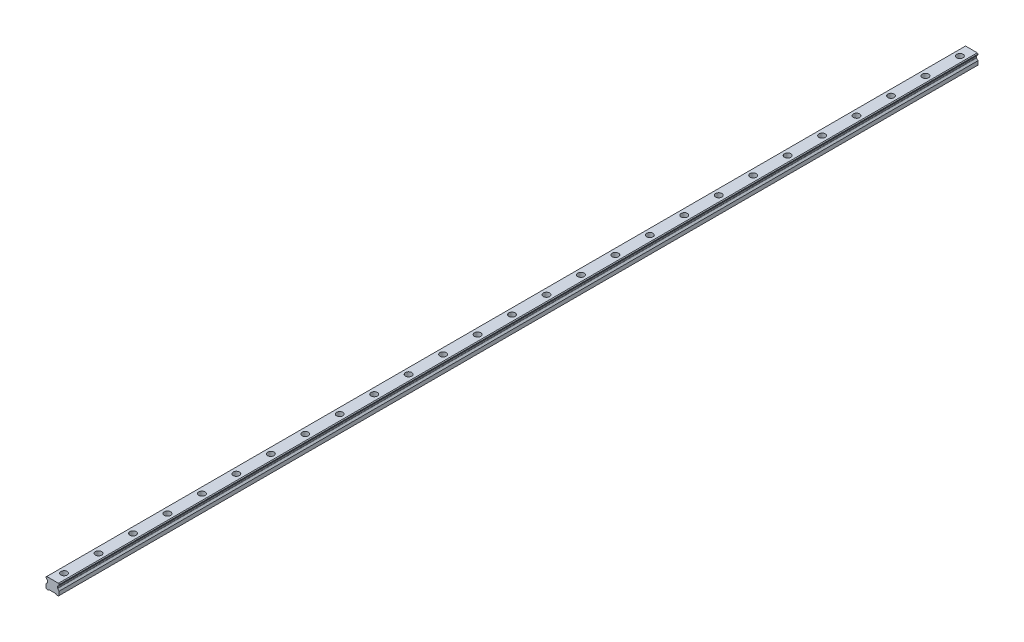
ISO-10303-21;
HEADER;
FILE_DESCRIPTION(('STEP AP214'),'2;1');
FILE_NAME('part.step','',(''),(''),'','','');
FILE_SCHEMA(('AUTOMOTIVE_DESIGN { 1 0 10303 214 1 1 1 1 }'));
ENDSEC;
DATA;
#1=APPLICATION_CONTEXT('core data for automotive mechanical design processes');
#2=APPLICATION_PROTOCOL_DEFINITION('international standard','automotive_design',2000,#1);
#3=PRODUCT_CONTEXT('',#1,'mechanical');
#4=PRODUCT('Part','Part','',(#3));
#5=PRODUCT_RELATED_PRODUCT_CATEGORY('part','',(#4));
#6=PRODUCT_DEFINITION_FORMATION('','',#4);
#7=PRODUCT_DEFINITION_CONTEXT('part definition',#1,'design');
#8=PRODUCT_DEFINITION('design','',#6,#7);
#9=PRODUCT_DEFINITION_SHAPE('','',#8);
#10=(LENGTH_UNIT() NAMED_UNIT(*) SI_UNIT(.MILLI.,.METRE.));
#11=(NAMED_UNIT(*) PLANE_ANGLE_UNIT() SI_UNIT($,.RADIAN.));
#12=(NAMED_UNIT(*) SI_UNIT($,.STERADIAN.) SOLID_ANGLE_UNIT());
#13=UNCERTAINTY_MEASURE_WITH_UNIT(LENGTH_MEASURE(1.E-05),#10,'distance_accuracy_value','');
#14=(GEOMETRIC_REPRESENTATION_CONTEXT(3) GLOBAL_UNCERTAINTY_ASSIGNED_CONTEXT((#13)) GLOBAL_UNIT_ASSIGNED_CONTEXT((#10,
#11,#12)) REPRESENTATION_CONTEXT('',''));
#15=CARTESIAN_POINT('',(0.,0.,0.));
#16=DIRECTION('',(0.,0.,1.));
#17=DIRECTION('',(1.,0.,0.));
#18=AXIS2_PLACEMENT_3D('',#15,#16,#17);
#19=CARTESIAN_POINT('',(0.,10.2,-780.));
#20=DIRECTION('',(0.,1.,0.));
#21=DIRECTION('',(0.,0.,1.));
#22=AXIS2_PLACEMENT_3D('',#19,#20,#21);
#23=PLANE('',#22);
#24=CARTESIAN_POINT('',(0.,10.2,-780.));
#25=DIRECTION('',(0.,1.,0.));
#26=DIRECTION('',(0.,0.,1.));
#27=AXIS2_PLACEMENT_3D('',#24,#25,#26);
#28=CIRCLE('',#27,3.5);
#29=CARTESIAN_POINT('',(0.,10.2,-776.5));
#30=VERTEX_POINT('',#29);
#31=EDGE_CURVE('E557',#30,#30,#28,.T.);
#32=ORIENTED_EDGE('',*,*,#31,.F.);
#33=EDGE_LOOP('',(#32));
#34=FACE_BOUND('',#33,.T.);
#35=CARTESIAN_POINT('',(0.,10.2,-780.));
#36=DIRECTION('',(0.,1.,0.));
#37=DIRECTION('',(0.,0.,1.));
#38=AXIS2_PLACEMENT_3D('',#35,#36,#37);
#39=CIRCLE('',#38,5.5);
#40=CARTESIAN_POINT('',(0.,10.2,-774.5));
#41=VERTEX_POINT('',#40);
#42=EDGE_CURVE('E11',#41,#41,#39,.T.);
#43=ORIENTED_EDGE('',*,*,#42,.T.);
#44=EDGE_LOOP('',(#43));
#45=FACE_BOUND('',#44,.T.);
#46=ADVANCED_FACE('F39',(#34,#45),#23,.T.);
#47=CARTESIAN_POINT('',(0.,10.2,-780.));
#48=DIRECTION('',(0.,1.,0.));
#49=DIRECTION('',(0.,0.,1.));
#50=AXIS2_PLACEMENT_3D('',#47,#48,#49);
#51=CYLINDRICAL_SURFACE('',#50,5.5);
#52=ORIENTED_EDGE('',*,*,#42,.F.);
#53=EDGE_LOOP('',(#52));
#54=FACE_BOUND('',#53,.T.);
#55=CARTESIAN_POINT('',(0.,19.2,-780.));
#56=DIRECTION('',(0.,1.,0.));
#57=DIRECTION('',(0.,0.,1.));
#58=AXIS2_PLACEMENT_3D('',#55,#56,#57);
#59=CIRCLE('',#58,5.5);
#60=CARTESIAN_POINT('',(0.,19.2,-774.5));
#61=VERTEX_POINT('',#60);
#62=EDGE_CURVE('E48',#61,#61,#59,.T.);
#63=ORIENTED_EDGE('',*,*,#62,.T.);
#64=EDGE_LOOP('',(#63));
#65=FACE_BOUND('',#64,.T.);
#66=ADVANCED_FACE('F972',(#54,#65),#51,.F.);
#67=CARTESIAN_POINT('',(0.,10.2,-720.));
#68=DIRECTION('',(0.,1.,0.));
#69=DIRECTION('',(0.,0.,1.));
#70=AXIS2_PLACEMENT_3D('',#67,#68,#69);
#71=PLANE('',#70);
#72=CARTESIAN_POINT('',(0.,10.2,-720.));
#73=DIRECTION('',(0.,1.,0.));
#74=DIRECTION('',(0.,0.,1.));
#75=AXIS2_PLACEMENT_3D('',#72,#73,#74);
#76=CIRCLE('',#75,3.5);
#77=CARTESIAN_POINT('',(0.,10.2,-716.5));
#78=VERTEX_POINT('',#77);
#79=EDGE_CURVE('E562',#78,#78,#76,.T.);
#80=ORIENTED_EDGE('',*,*,#79,.F.);
#81=EDGE_LOOP('',(#80));
#82=FACE_BOUND('',#81,.T.);
#83=CARTESIAN_POINT('',(0.,10.2,-720.));
#84=DIRECTION('',(0.,1.,0.));
#85=DIRECTION('',(0.,0.,1.));
#86=AXIS2_PLACEMENT_3D('',#83,#84,#85);
#87=CIRCLE('',#86,5.5);
#88=CARTESIAN_POINT('',(0.,10.2,-714.5));
#89=VERTEX_POINT('',#88);
#90=EDGE_CURVE('E541',#89,#89,#87,.T.);
#91=ORIENTED_EDGE('',*,*,#90,.T.);
#92=EDGE_LOOP('',(#91));
#93=FACE_BOUND('',#92,.T.);
#94=ADVANCED_FACE('F974',(#82,#93),#71,.T.);
#95=CARTESIAN_POINT('',(0.,10.2,-720.));
#96=DIRECTION('',(0.,1.,0.));
#97=DIRECTION('',(0.,0.,1.));
#98=AXIS2_PLACEMENT_3D('',#95,#96,#97);
#99=CYLINDRICAL_SURFACE('',#98,5.5);
#100=ORIENTED_EDGE('',*,*,#90,.F.);
#101=EDGE_LOOP('',(#100));
#102=FACE_BOUND('',#101,.T.);
#103=CARTESIAN_POINT('',(0.,19.2,-720.));
#104=DIRECTION('',(0.,1.,0.));
#105=DIRECTION('',(0.,0.,1.));
#106=AXIS2_PLACEMENT_3D('',#103,#104,#105);
#107=CIRCLE('',#106,5.5);
#108=CARTESIAN_POINT('',(0.,19.2,-714.5));
#109=VERTEX_POINT('',#108);
#110=EDGE_CURVE('E537',#109,#109,#107,.T.);
#111=ORIENTED_EDGE('',*,*,#110,.T.);
#112=EDGE_LOOP('',(#111));
#113=FACE_BOUND('',#112,.T.);
#114=ADVANCED_FACE('F980',(#102,#113),#99,.F.);
#115=CARTESIAN_POINT('',(0.,10.2,-660.));
#116=DIRECTION('',(0.,1.,0.));
#117=DIRECTION('',(0.,0.,1.));
#118=AXIS2_PLACEMENT_3D('',#115,#116,#117);
#119=PLANE('',#118);
#120=CARTESIAN_POINT('',(0.,10.2,-660.));
#121=DIRECTION('',(0.,1.,0.));
#122=DIRECTION('',(0.,0.,1.));
#123=AXIS2_PLACEMENT_3D('',#120,#121,#122);
#124=CIRCLE('',#123,3.5);
#125=CARTESIAN_POINT('',(0.,10.2,-656.5));
#126=VERTEX_POINT('',#125);
#127=EDGE_CURVE('E567',#126,#126,#124,.T.);
#128=ORIENTED_EDGE('',*,*,#127,.F.);
#129=EDGE_LOOP('',(#128));
#130=FACE_BOUND('',#129,.T.);
#131=CARTESIAN_POINT('',(0.,10.2,-660.));
#132=DIRECTION('',(0.,1.,0.));
#133=DIRECTION('',(0.,0.,1.));
#134=AXIS2_PLACEMENT_3D('',#131,#132,#133);
#135=CIRCLE('',#134,5.5);
#136=CARTESIAN_POINT('',(0.,10.2,-654.5));
#137=VERTEX_POINT('',#136);
#138=EDGE_CURVE('E533',#137,#137,#135,.T.);
#139=ORIENTED_EDGE('',*,*,#138,.T.);
#140=EDGE_LOOP('',(#139));
#141=FACE_BOUND('',#140,.T.);
#142=ADVANCED_FACE('F988',(#130,#141),#119,.T.);
#143=CARTESIAN_POINT('',(0.,10.2,-660.));
#144=DIRECTION('',(0.,1.,0.));
#145=DIRECTION('',(0.,0.,1.));
#146=AXIS2_PLACEMENT_3D('',#143,#144,#145);
#147=CYLINDRICAL_SURFACE('',#146,5.5);
#148=ORIENTED_EDGE('',*,*,#138,.F.);
#149=EDGE_LOOP('',(#148));
#150=FACE_BOUND('',#149,.T.);
#151=CARTESIAN_POINT('',(0.,19.2,-660.));
#152=DIRECTION('',(0.,1.,0.));
#153=DIRECTION('',(0.,0.,1.));
#154=AXIS2_PLACEMENT_3D('',#151,#152,#153);
#155=CIRCLE('',#154,5.5);
#156=CARTESIAN_POINT('',(0.,19.2,-654.5));
#157=VERTEX_POINT('',#156);
#158=EDGE_CURVE('E529',#157,#157,#155,.T.);
#159=ORIENTED_EDGE('',*,*,#158,.T.);
#160=EDGE_LOOP('',(#159));
#161=FACE_BOUND('',#160,.T.);
#162=ADVANCED_FACE('F992',(#150,#161),#147,.F.);
#163=CARTESIAN_POINT('',(0.,10.2,-600.));
#164=DIRECTION('',(0.,1.,0.));
#165=DIRECTION('',(0.,0.,1.));
#166=AXIS2_PLACEMENT_3D('',#163,#164,#165);
#167=PLANE('',#166);
#168=CARTESIAN_POINT('',(0.,10.2,-600.));
#169=DIRECTION('',(0.,1.,0.));
#170=DIRECTION('',(0.,0.,1.));
#171=AXIS2_PLACEMENT_3D('',#168,#169,#170);
#172=CIRCLE('',#171,3.5);
#173=CARTESIAN_POINT('',(0.,10.2,-596.5));
#174=VERTEX_POINT('',#173);
#175=EDGE_CURVE('E572',#174,#174,#172,.T.);
#176=ORIENTED_EDGE('',*,*,#175,.F.);
#177=EDGE_LOOP('',(#176));
#178=FACE_BOUND('',#177,.T.);
#179=CARTESIAN_POINT('',(0.,10.2,-600.));
#180=DIRECTION('',(0.,1.,0.));
#181=DIRECTION('',(0.,0.,1.));
#182=AXIS2_PLACEMENT_3D('',#179,#180,#181);
#183=CIRCLE('',#182,5.5);
#184=CARTESIAN_POINT('',(0.,10.2,-594.5));
#185=VERTEX_POINT('',#184);
#186=EDGE_CURVE('E525',#185,#185,#183,.T.);
#187=ORIENTED_EDGE('',*,*,#186,.T.);
#188=EDGE_LOOP('',(#187));
#189=FACE_BOUND('',#188,.T.);
#190=ADVANCED_FACE('F996',(#178,#189),#167,.T.);
#191=CARTESIAN_POINT('',(0.,10.2,-600.));
#192=DIRECTION('',(0.,1.,0.));
#193=DIRECTION('',(0.,0.,1.));
#194=AXIS2_PLACEMENT_3D('',#191,#192,#193);
#195=CYLINDRICAL_SURFACE('',#194,5.5);
#196=ORIENTED_EDGE('',*,*,#186,.F.);
#197=EDGE_LOOP('',(#196));
#198=FACE_BOUND('',#197,.T.);
#199=CARTESIAN_POINT('',(0.,19.2,-600.));
#200=DIRECTION('',(0.,1.,0.));
#201=DIRECTION('',(0.,0.,1.));
#202=AXIS2_PLACEMENT_3D('',#199,#200,#201);
#203=CIRCLE('',#202,5.5);
#204=CARTESIAN_POINT('',(0.,19.2,-594.5));
#205=VERTEX_POINT('',#204);
#206=EDGE_CURVE('E521',#205,#205,#203,.T.);
#207=ORIENTED_EDGE('',*,*,#206,.T.);
#208=EDGE_LOOP('',(#207));
#209=FACE_BOUND('',#208,.T.);
#210=ADVANCED_FACE('F1000',(#198,#209),#195,.F.);
#211=CARTESIAN_POINT('',(0.,10.2,-540.));
#212=DIRECTION('',(0.,1.,0.));
#213=DIRECTION('',(0.,0.,1.));
#214=AXIS2_PLACEMENT_3D('',#211,#212,#213);
#215=PLANE('',#214);
#216=CARTESIAN_POINT('',(0.,10.2,-540.));
#217=DIRECTION('',(0.,1.,0.));
#218=DIRECTION('',(0.,0.,1.));
#219=AXIS2_PLACEMENT_3D('',#216,#217,#218);
#220=CIRCLE('',#219,3.5);
#221=CARTESIAN_POINT('',(0.,10.2,-536.5));
#222=VERTEX_POINT('',#221);
#223=EDGE_CURVE('E577',#222,#222,#220,.T.);
#224=ORIENTED_EDGE('',*,*,#223,.F.);
#225=EDGE_LOOP('',(#224));
#226=FACE_BOUND('',#225,.T.);
#227=CARTESIAN_POINT('',(0.,10.2,-540.));
#228=DIRECTION('',(0.,1.,0.));
#229=DIRECTION('',(0.,0.,1.));
#230=AXIS2_PLACEMENT_3D('',#227,#228,#229);
#231=CIRCLE('',#230,5.5);
#232=CARTESIAN_POINT('',(0.,10.2,-534.5));
#233=VERTEX_POINT('',#232);
#234=EDGE_CURVE('E517',#233,#233,#231,.T.);
#235=ORIENTED_EDGE('',*,*,#234,.T.);
#236=EDGE_LOOP('',(#235));
#237=FACE_BOUND('',#236,.T.);
#238=ADVANCED_FACE('F1004',(#226,#237),#215,.T.);
#239=CARTESIAN_POINT('',(0.,10.2,-540.));
#240=DIRECTION('',(0.,1.,0.));
#241=DIRECTION('',(0.,0.,1.));
#242=AXIS2_PLACEMENT_3D('',#239,#240,#241);
#243=CYLINDRICAL_SURFACE('',#242,5.5);
#244=ORIENTED_EDGE('',*,*,#234,.F.);
#245=EDGE_LOOP('',(#244));
#246=FACE_BOUND('',#245,.T.);
#247=CARTESIAN_POINT('',(0.,19.2,-540.));
#248=DIRECTION('',(0.,1.,0.));
#249=DIRECTION('',(0.,0.,1.));
#250=AXIS2_PLACEMENT_3D('',#247,#248,#249);
#251=CIRCLE('',#250,5.5);
#252=CARTESIAN_POINT('',(0.,19.2,-534.5));
#253=VERTEX_POINT('',#252);
#254=EDGE_CURVE('E513',#253,#253,#251,.T.);
#255=ORIENTED_EDGE('',*,*,#254,.T.);
#256=EDGE_LOOP('',(#255));
#257=FACE_BOUND('',#256,.T.);
#258=ADVANCED_FACE('F1008',(#246,#257),#243,.F.);
#259=CARTESIAN_POINT('',(0.,10.2,-480.));
#260=DIRECTION('',(0.,1.,0.));
#261=DIRECTION('',(0.,0.,1.));
#262=AXIS2_PLACEMENT_3D('',#259,#260,#261);
#263=PLANE('',#262);
#264=CARTESIAN_POINT('',(0.,10.2,-480.));
#265=DIRECTION('',(0.,1.,0.));
#266=DIRECTION('',(0.,0.,1.));
#267=AXIS2_PLACEMENT_3D('',#264,#265,#266);
#268=CIRCLE('',#267,3.5);
#269=CARTESIAN_POINT('',(0.,10.2,-476.5));
#270=VERTEX_POINT('',#269);
#271=EDGE_CURVE('E582',#270,#270,#268,.T.);
#272=ORIENTED_EDGE('',*,*,#271,.F.);
#273=EDGE_LOOP('',(#272));
#274=FACE_BOUND('',#273,.T.);
#275=CARTESIAN_POINT('',(0.,10.2,-480.));
#276=DIRECTION('',(0.,1.,0.));
#277=DIRECTION('',(0.,0.,1.));
#278=AXIS2_PLACEMENT_3D('',#275,#276,#277);
#279=CIRCLE('',#278,5.5);
#280=CARTESIAN_POINT('',(0.,10.2,-474.5));
#281=VERTEX_POINT('',#280);
#282=EDGE_CURVE('E509',#281,#281,#279,.T.);
#283=ORIENTED_EDGE('',*,*,#282,.T.);
#284=EDGE_LOOP('',(#283));
#285=FACE_BOUND('',#284,.T.);
#286=ADVANCED_FACE('F1012',(#274,#285),#263,.T.);
#287=CARTESIAN_POINT('',(0.,10.2,-480.));
#288=DIRECTION('',(0.,1.,0.));
#289=DIRECTION('',(0.,0.,1.));
#290=AXIS2_PLACEMENT_3D('',#287,#288,#289);
#291=CYLINDRICAL_SURFACE('',#290,5.5);
#292=ORIENTED_EDGE('',*,*,#282,.F.);
#293=EDGE_LOOP('',(#292));
#294=FACE_BOUND('',#293,.T.);
#295=CARTESIAN_POINT('',(0.,19.2,-480.));
#296=DIRECTION('',(0.,1.,0.));
#297=DIRECTION('',(0.,0.,1.));
#298=AXIS2_PLACEMENT_3D('',#295,#296,#297);
#299=CIRCLE('',#298,5.5);
#300=CARTESIAN_POINT('',(0.,19.2,-474.5));
#301=VERTEX_POINT('',#300);
#302=EDGE_CURVE('E505',#301,#301,#299,.T.);
#303=ORIENTED_EDGE('',*,*,#302,.T.);
#304=EDGE_LOOP('',(#303));
#305=FACE_BOUND('',#304,.T.);
#306=ADVANCED_FACE('F1016',(#294,#305),#291,.F.);
#307=CARTESIAN_POINT('',(0.,10.2,-420.));
#308=DIRECTION('',(0.,1.,0.));
#309=DIRECTION('',(0.,0.,1.));
#310=AXIS2_PLACEMENT_3D('',#307,#308,#309);
#311=PLANE('',#310);
#312=CARTESIAN_POINT('',(0.,10.2,-420.));
#313=DIRECTION('',(0.,1.,0.));
#314=DIRECTION('',(0.,0.,1.));
#315=AXIS2_PLACEMENT_3D('',#312,#313,#314);
#316=CIRCLE('',#315,3.5);
#317=CARTESIAN_POINT('',(0.,10.2,-416.5));
#318=VERTEX_POINT('',#317);
#319=EDGE_CURVE('E587',#318,#318,#316,.T.);
#320=ORIENTED_EDGE('',*,*,#319,.F.);
#321=EDGE_LOOP('',(#320));
#322=FACE_BOUND('',#321,.T.);
#323=CARTESIAN_POINT('',(0.,10.2,-420.));
#324=DIRECTION('',(0.,1.,0.));
#325=DIRECTION('',(0.,0.,1.));
#326=AXIS2_PLACEMENT_3D('',#323,#324,#325);
#327=CIRCLE('',#326,5.5);
#328=CARTESIAN_POINT('',(0.,10.2,-414.5));
#329=VERTEX_POINT('',#328);
#330=EDGE_CURVE('E501',#329,#329,#327,.T.);
#331=ORIENTED_EDGE('',*,*,#330,.T.);
#332=EDGE_LOOP('',(#331));
#333=FACE_BOUND('',#332,.T.);
#334=ADVANCED_FACE('F1020',(#322,#333),#311,.T.);
#335=CARTESIAN_POINT('',(0.,10.2,-420.));
#336=DIRECTION('',(0.,1.,0.));
#337=DIRECTION('',(0.,0.,1.));
#338=AXIS2_PLACEMENT_3D('',#335,#336,#337);
#339=CYLINDRICAL_SURFACE('',#338,5.5);
#340=ORIENTED_EDGE('',*,*,#330,.F.);
#341=EDGE_LOOP('',(#340));
#342=FACE_BOUND('',#341,.T.);
#343=CARTESIAN_POINT('',(0.,19.2,-420.));
#344=DIRECTION('',(0.,1.,0.));
#345=DIRECTION('',(0.,0.,1.));
#346=AXIS2_PLACEMENT_3D('',#343,#344,#345);
#347=CIRCLE('',#346,5.5);
#348=CARTESIAN_POINT('',(0.,19.2,-414.5));
#349=VERTEX_POINT('',#348);
#350=EDGE_CURVE('E497',#349,#349,#347,.T.);
#351=ORIENTED_EDGE('',*,*,#350,.T.);
#352=EDGE_LOOP('',(#351));
#353=FACE_BOUND('',#352,.T.);
#354=ADVANCED_FACE('F1024',(#342,#353),#339,.F.);
#355=CARTESIAN_POINT('',(0.,10.2,-360.));
#356=DIRECTION('',(0.,1.,0.));
#357=DIRECTION('',(0.,0.,1.));
#358=AXIS2_PLACEMENT_3D('',#355,#356,#357);
#359=PLANE('',#358);
#360=CARTESIAN_POINT('',(0.,10.2,-360.));
#361=DIRECTION('',(0.,1.,0.));
#362=DIRECTION('',(0.,0.,1.));
#363=AXIS2_PLACEMENT_3D('',#360,#361,#362);
#364=CIRCLE('',#363,3.5);
#365=CARTESIAN_POINT('',(0.,10.2,-356.5));
#366=VERTEX_POINT('',#365);
#367=EDGE_CURVE('E592',#366,#366,#364,.T.);
#368=ORIENTED_EDGE('',*,*,#367,.F.);
#369=EDGE_LOOP('',(#368));
#370=FACE_BOUND('',#369,.T.);
#371=CARTESIAN_POINT('',(0.,10.2,-360.));
#372=DIRECTION('',(0.,1.,0.));
#373=DIRECTION('',(0.,0.,1.));
#374=AXIS2_PLACEMENT_3D('',#371,#372,#373);
#375=CIRCLE('',#374,5.5);
#376=CARTESIAN_POINT('',(0.,10.2,-354.5));
#377=VERTEX_POINT('',#376);
#378=EDGE_CURVE('E493',#377,#377,#375,.T.);
#379=ORIENTED_EDGE('',*,*,#378,.T.);
#380=EDGE_LOOP('',(#379));
#381=FACE_BOUND('',#380,.T.);
#382=ADVANCED_FACE('F1028',(#370,#381),#359,.T.);
#383=CARTESIAN_POINT('',(0.,10.2,-360.));
#384=DIRECTION('',(0.,1.,0.));
#385=DIRECTION('',(0.,0.,1.));
#386=AXIS2_PLACEMENT_3D('',#383,#384,#385);
#387=CYLINDRICAL_SURFACE('',#386,5.5);
#388=ORIENTED_EDGE('',*,*,#378,.F.);
#389=EDGE_LOOP('',(#388));
#390=FACE_BOUND('',#389,.T.);
#391=CARTESIAN_POINT('',(0.,19.2,-360.));
#392=DIRECTION('',(0.,1.,0.));
#393=DIRECTION('',(0.,0.,1.));
#394=AXIS2_PLACEMENT_3D('',#391,#392,#393);
#395=CIRCLE('',#394,5.5);
#396=CARTESIAN_POINT('',(0.,19.2,-354.5));
#397=VERTEX_POINT('',#396);
#398=EDGE_CURVE('E489',#397,#397,#395,.T.);
#399=ORIENTED_EDGE('',*,*,#398,.T.);
#400=EDGE_LOOP('',(#399));
#401=FACE_BOUND('',#400,.T.);
#402=ADVANCED_FACE('F1032',(#390,#401),#387,.F.);
#403=CARTESIAN_POINT('',(0.,10.2,-300.));
#404=DIRECTION('',(0.,1.,0.));
#405=DIRECTION('',(0.,0.,1.));
#406=AXIS2_PLACEMENT_3D('',#403,#404,#405);
#407=PLANE('',#406);
#408=CARTESIAN_POINT('',(0.,10.2,-300.));
#409=DIRECTION('',(0.,1.,0.));
#410=DIRECTION('',(0.,0.,1.));
#411=AXIS2_PLACEMENT_3D('',#408,#409,#410);
#412=CIRCLE('',#411,3.5);
#413=CARTESIAN_POINT('',(0.,10.2,-296.5));
#414=VERTEX_POINT('',#413);
#415=EDGE_CURVE('E597',#414,#414,#412,.T.);
#416=ORIENTED_EDGE('',*,*,#415,.F.);
#417=EDGE_LOOP('',(#416));
#418=FACE_BOUND('',#417,.T.);
#419=CARTESIAN_POINT('',(0.,10.2,-300.));
#420=DIRECTION('',(0.,1.,0.));
#421=DIRECTION('',(0.,0.,1.));
#422=AXIS2_PLACEMENT_3D('',#419,#420,#421);
#423=CIRCLE('',#422,5.5);
#424=CARTESIAN_POINT('',(0.,10.2,-294.5));
#425=VERTEX_POINT('',#424);
#426=EDGE_CURVE('E485',#425,#425,#423,.T.);
#427=ORIENTED_EDGE('',*,*,#426,.T.);
#428=EDGE_LOOP('',(#427));
#429=FACE_BOUND('',#428,.T.);
#430=ADVANCED_FACE('F1036',(#418,#429),#407,.T.);
#431=CARTESIAN_POINT('',(0.,10.2,-300.));
#432=DIRECTION('',(0.,1.,0.));
#433=DIRECTION('',(0.,0.,1.));
#434=AXIS2_PLACEMENT_3D('',#431,#432,#433);
#435=CYLINDRICAL_SURFACE('',#434,5.5);
#436=ORIENTED_EDGE('',*,*,#426,.F.);
#437=EDGE_LOOP('',(#436));
#438=FACE_BOUND('',#437,.T.);
#439=CARTESIAN_POINT('',(0.,19.2,-300.));
#440=DIRECTION('',(0.,1.,0.));
#441=DIRECTION('',(0.,0.,1.));
#442=AXIS2_PLACEMENT_3D('',#439,#440,#441);
#443=CIRCLE('',#442,5.5);
#444=CARTESIAN_POINT('',(0.,19.2,-294.5));
#445=VERTEX_POINT('',#444);
#446=EDGE_CURVE('E481',#445,#445,#443,.T.);
#447=ORIENTED_EDGE('',*,*,#446,.T.);
#448=EDGE_LOOP('',(#447));
#449=FACE_BOUND('',#448,.T.);
#450=ADVANCED_FACE('F1040',(#438,#449),#435,.F.);
#451=CARTESIAN_POINT('',(0.,10.2,-240.));
#452=DIRECTION('',(0.,1.,0.));
#453=DIRECTION('',(0.,0.,1.));
#454=AXIS2_PLACEMENT_3D('',#451,#452,#453);
#455=PLANE('',#454);
#456=CARTESIAN_POINT('',(0.,10.2,-240.));
#457=DIRECTION('',(0.,1.,0.));
#458=DIRECTION('',(0.,0.,1.));
#459=AXIS2_PLACEMENT_3D('',#456,#457,#458);
#460=CIRCLE('',#459,3.5);
#461=CARTESIAN_POINT('',(0.,10.2,-236.5));
#462=VERTEX_POINT('',#461);
#463=EDGE_CURVE('E602',#462,#462,#460,.T.);
#464=ORIENTED_EDGE('',*,*,#463,.F.);
#465=EDGE_LOOP('',(#464));
#466=FACE_BOUND('',#465,.T.);
#467=CARTESIAN_POINT('',(0.,10.2,-240.));
#468=DIRECTION('',(0.,1.,0.));
#469=DIRECTION('',(0.,0.,1.));
#470=AXIS2_PLACEMENT_3D('',#467,#468,#469);
#471=CIRCLE('',#470,5.5);
#472=CARTESIAN_POINT('',(0.,10.2,-234.5));
#473=VERTEX_POINT('',#472);
#474=EDGE_CURVE('E477',#473,#473,#471,.T.);
#475=ORIENTED_EDGE('',*,*,#474,.T.);
#476=EDGE_LOOP('',(#475));
#477=FACE_BOUND('',#476,.T.);
#478=ADVANCED_FACE('F1044',(#466,#477),#455,.T.);
#479=CARTESIAN_POINT('',(0.,10.2,-240.));
#480=DIRECTION('',(0.,1.,0.));
#481=DIRECTION('',(0.,0.,1.));
#482=AXIS2_PLACEMENT_3D('',#479,#480,#481);
#483=CYLINDRICAL_SURFACE('',#482,5.5);
#484=ORIENTED_EDGE('',*,*,#474,.F.);
#485=EDGE_LOOP('',(#484));
#486=FACE_BOUND('',#485,.T.);
#487=CARTESIAN_POINT('',(0.,19.2,-240.));
#488=DIRECTION('',(0.,1.,0.));
#489=DIRECTION('',(0.,0.,1.));
#490=AXIS2_PLACEMENT_3D('',#487,#488,#489);
#491=CIRCLE('',#490,5.5);
#492=CARTESIAN_POINT('',(0.,19.2,-234.5));
#493=VERTEX_POINT('',#492);
#494=EDGE_CURVE('E473',#493,#493,#491,.T.);
#495=ORIENTED_EDGE('',*,*,#494,.T.);
#496=EDGE_LOOP('',(#495));
#497=FACE_BOUND('',#496,.T.);
#498=ADVANCED_FACE('F1048',(#486,#497),#483,.F.);
#499=CARTESIAN_POINT('',(0.,10.2,-180.));
#500=DIRECTION('',(0.,1.,0.));
#501=DIRECTION('',(0.,0.,1.));
#502=AXIS2_PLACEMENT_3D('',#499,#500,#501);
#503=PLANE('',#502);
#504=CARTESIAN_POINT('',(0.,10.2,-180.));
#505=DIRECTION('',(0.,1.,0.));
#506=DIRECTION('',(0.,0.,1.));
#507=AXIS2_PLACEMENT_3D('',#504,#505,#506);
#508=CIRCLE('',#507,3.5);
#509=CARTESIAN_POINT('',(0.,10.2,-176.5));
#510=VERTEX_POINT('',#509);
#511=EDGE_CURVE('E607',#510,#510,#508,.T.);
#512=ORIENTED_EDGE('',*,*,#511,.F.);
#513=EDGE_LOOP('',(#512));
#514=FACE_BOUND('',#513,.T.);
#515=CARTESIAN_POINT('',(0.,10.2,-180.));
#516=DIRECTION('',(0.,1.,0.));
#517=DIRECTION('',(0.,0.,1.));
#518=AXIS2_PLACEMENT_3D('',#515,#516,#517);
#519=CIRCLE('',#518,5.5);
#520=CARTESIAN_POINT('',(0.,10.2,-174.5));
#521=VERTEX_POINT('',#520);
#522=EDGE_CURVE('E469',#521,#521,#519,.T.);
#523=ORIENTED_EDGE('',*,*,#522,.T.);
#524=EDGE_LOOP('',(#523));
#525=FACE_BOUND('',#524,.T.);
#526=ADVANCED_FACE('F1052',(#514,#525),#503,.T.);
#527=CARTESIAN_POINT('',(0.,10.2,-180.));
#528=DIRECTION('',(0.,1.,0.));
#529=DIRECTION('',(0.,0.,1.));
#530=AXIS2_PLACEMENT_3D('',#527,#528,#529);
#531=CYLINDRICAL_SURFACE('',#530,5.5);
#532=ORIENTED_EDGE('',*,*,#522,.F.);
#533=EDGE_LOOP('',(#532));
#534=FACE_BOUND('',#533,.T.);
#535=CARTESIAN_POINT('',(0.,19.2,-180.));
#536=DIRECTION('',(0.,1.,0.));
#537=DIRECTION('',(0.,0.,1.));
#538=AXIS2_PLACEMENT_3D('',#535,#536,#537);
#539=CIRCLE('',#538,5.5);
#540=CARTESIAN_POINT('',(0.,19.2,-174.5));
#541=VERTEX_POINT('',#540);
#542=EDGE_CURVE('E465',#541,#541,#539,.T.);
#543=ORIENTED_EDGE('',*,*,#542,.T.);
#544=EDGE_LOOP('',(#543));
#545=FACE_BOUND('',#544,.T.);
#546=ADVANCED_FACE('F1056',(#534,#545),#531,.F.);
#547=CARTESIAN_POINT('',(0.,10.2,-120.));
#548=DIRECTION('',(0.,1.,0.));
#549=DIRECTION('',(0.,0.,1.));
#550=AXIS2_PLACEMENT_3D('',#547,#548,#549);
#551=PLANE('',#550);
#552=CARTESIAN_POINT('',(0.,10.2,-120.));
#553=DIRECTION('',(0.,1.,0.));
#554=DIRECTION('',(0.,0.,1.));
#555=AXIS2_PLACEMENT_3D('',#552,#553,#554);
#556=CIRCLE('',#555,3.5);
#557=CARTESIAN_POINT('',(0.,10.2,-116.5));
#558=VERTEX_POINT('',#557);
#559=EDGE_CURVE('E612',#558,#558,#556,.T.);
#560=ORIENTED_EDGE('',*,*,#559,.F.);
#561=EDGE_LOOP('',(#560));
#562=FACE_BOUND('',#561,.T.);
#563=CARTESIAN_POINT('',(0.,10.2,-120.));
#564=DIRECTION('',(0.,1.,0.));
#565=DIRECTION('',(0.,0.,1.));
#566=AXIS2_PLACEMENT_3D('',#563,#564,#565);
#567=CIRCLE('',#566,5.5);
#568=CARTESIAN_POINT('',(0.,10.2,-114.5));
#569=VERTEX_POINT('',#568);
#570=EDGE_CURVE('E461',#569,#569,#567,.T.);
#571=ORIENTED_EDGE('',*,*,#570,.T.);
#572=EDGE_LOOP('',(#571));
#573=FACE_BOUND('',#572,.T.);
#574=ADVANCED_FACE('F1060',(#562,#573),#551,.T.);
#575=CARTESIAN_POINT('',(0.,10.2,-120.));
#576=DIRECTION('',(0.,1.,0.));
#577=DIRECTION('',(0.,0.,1.));
#578=AXIS2_PLACEMENT_3D('',#575,#576,#577);
#579=CYLINDRICAL_SURFACE('',#578,5.5);
#580=ORIENTED_EDGE('',*,*,#570,.F.);
#581=EDGE_LOOP('',(#580));
#582=FACE_BOUND('',#581,.T.);
#583=CARTESIAN_POINT('',(0.,19.2,-120.));
#584=DIRECTION('',(0.,1.,0.));
#585=DIRECTION('',(0.,0.,1.));
#586=AXIS2_PLACEMENT_3D('',#583,#584,#585);
#587=CIRCLE('',#586,5.5);
#588=CARTESIAN_POINT('',(0.,19.2,-114.5));
#589=VERTEX_POINT('',#588);
#590=EDGE_CURVE('E457',#589,#589,#587,.T.);
#591=ORIENTED_EDGE('',*,*,#590,.T.);
#592=EDGE_LOOP('',(#591));
#593=FACE_BOUND('',#592,.T.);
#594=ADVANCED_FACE('F1064',(#582,#593),#579,.F.);
#595=CARTESIAN_POINT('',(0.,10.2,-60.0000000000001));
#596=DIRECTION('',(0.,1.,0.));
#597=DIRECTION('',(0.,0.,1.));
#598=AXIS2_PLACEMENT_3D('',#595,#596,#597);
#599=PLANE('',#598);
#600=CARTESIAN_POINT('',(0.,10.2,-59.9999999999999));
#601=DIRECTION('',(0.,1.,0.));
#602=DIRECTION('',(0.,0.,1.));
#603=AXIS2_PLACEMENT_3D('',#600,#601,#602);
#604=CIRCLE('',#603,3.5);
#605=CARTESIAN_POINT('',(0.,10.2,-56.4999999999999));
#606=VERTEX_POINT('',#605);
#607=EDGE_CURVE('E617',#606,#606,#604,.T.);
#608=ORIENTED_EDGE('',*,*,#607,.F.);
#609=EDGE_LOOP('',(#608));
#610=FACE_BOUND('',#609,.T.);
#611=CARTESIAN_POINT('',(0.,10.2,-60.0000000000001));
#612=DIRECTION('',(0.,1.,0.));
#613=DIRECTION('',(0.,0.,1.));
#614=AXIS2_PLACEMENT_3D('',#611,#612,#613);
#615=CIRCLE('',#614,5.5);
#616=CARTESIAN_POINT('',(0.,10.2,-54.5000000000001));
#617=VERTEX_POINT('',#616);
#618=EDGE_CURVE('E453',#617,#617,#615,.T.);
#619=ORIENTED_EDGE('',*,*,#618,.T.);
#620=EDGE_LOOP('',(#619));
#621=FACE_BOUND('',#620,.T.);
#622=ADVANCED_FACE('F1068',(#610,#621),#599,.T.);
#623=CARTESIAN_POINT('',(0.,10.2,-60.0000000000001));
#624=DIRECTION('',(0.,1.,0.));
#625=DIRECTION('',(0.,0.,1.));
#626=AXIS2_PLACEMENT_3D('',#623,#624,#625);
#627=CYLINDRICAL_SURFACE('',#626,5.5);
#628=ORIENTED_EDGE('',*,*,#618,.F.);
#629=EDGE_LOOP('',(#628));
#630=FACE_BOUND('',#629,.T.);
#631=CARTESIAN_POINT('',(0.,19.2,-60.0000000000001));
#632=DIRECTION('',(0.,1.,0.));
#633=DIRECTION('',(0.,0.,1.));
#634=AXIS2_PLACEMENT_3D('',#631,#632,#633);
#635=CIRCLE('',#634,5.5);
#636=CARTESIAN_POINT('',(0.,19.2,-54.5000000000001));
#637=VERTEX_POINT('',#636);
#638=EDGE_CURVE('E449',#637,#637,#635,.T.);
#639=ORIENTED_EDGE('',*,*,#638,.T.);
#640=EDGE_LOOP('',(#639));
#641=FACE_BOUND('',#640,.T.);
#642=ADVANCED_FACE('F1072',(#630,#641),#627,.F.);
#643=CARTESIAN_POINT('',(0.,10.2,0.));
#644=DIRECTION('',(0.,1.,0.));
#645=DIRECTION('',(0.,0.,1.));
#646=AXIS2_PLACEMENT_3D('',#643,#644,#645);
#647=PLANE('',#646);
#648=CARTESIAN_POINT('',(0.,10.2,0.));
#649=DIRECTION('',(0.,1.,0.));
#650=DIRECTION('',(0.,0.,1.));
#651=AXIS2_PLACEMENT_3D('',#648,#649,#650);
#652=CIRCLE('',#651,3.5);
#653=CARTESIAN_POINT('',(0.,10.2,3.5));
#654=VERTEX_POINT('',#653);
#655=EDGE_CURVE('E622',#654,#654,#652,.T.);
#656=ORIENTED_EDGE('',*,*,#655,.F.);
#657=EDGE_LOOP('',(#656));
#658=FACE_BOUND('',#657,.T.);
#659=CARTESIAN_POINT('',(0.,10.2,0.));
#660=DIRECTION('',(0.,1.,0.));
#661=DIRECTION('',(0.,0.,1.));
#662=AXIS2_PLACEMENT_3D('',#659,#660,#661);
#663=CIRCLE('',#662,5.5);
#664=CARTESIAN_POINT('',(0.,10.2,5.5));
#665=VERTEX_POINT('',#664);
#666=EDGE_CURVE('E445',#665,#665,#663,.T.);
#667=ORIENTED_EDGE('',*,*,#666,.T.);
#668=EDGE_LOOP('',(#667));
#669=FACE_BOUND('',#668,.T.);
#670=ADVANCED_FACE('F1076',(#658,#669),#647,.T.);
#671=CARTESIAN_POINT('',(0.,10.2,0.));
#672=DIRECTION('',(0.,1.,0.));
#673=DIRECTION('',(0.,0.,1.));
#674=AXIS2_PLACEMENT_3D('',#671,#672,#673);
#675=CYLINDRICAL_SURFACE('',#674,5.5);
#676=ORIENTED_EDGE('',*,*,#666,.F.);
#677=EDGE_LOOP('',(#676));
#678=FACE_BOUND('',#677,.T.);
#679=CARTESIAN_POINT('',(0.,19.2,0.));
#680=DIRECTION('',(0.,1.,0.));
#681=DIRECTION('',(0.,0.,1.));
#682=AXIS2_PLACEMENT_3D('',#679,#680,#681);
#683=CIRCLE('',#682,5.5);
#684=CARTESIAN_POINT('',(0.,19.2,5.5));
#685=VERTEX_POINT('',#684);
#686=EDGE_CURVE('E441',#685,#685,#683,.T.);
#687=ORIENTED_EDGE('',*,*,#686,.T.);
#688=EDGE_LOOP('',(#687));
#689=FACE_BOUND('',#688,.T.);
#690=ADVANCED_FACE('F1080',(#678,#689),#675,.F.);
#691=CARTESIAN_POINT('',(0.,10.2,60.0000000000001));
#692=DIRECTION('',(0.,1.,0.));
#693=DIRECTION('',(0.,0.,1.));
#694=AXIS2_PLACEMENT_3D('',#691,#692,#693);
#695=PLANE('',#694);
#696=CARTESIAN_POINT('',(0.,10.2,60.0000000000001));
#697=DIRECTION('',(0.,1.,0.));
#698=DIRECTION('',(0.,0.,1.));
#699=AXIS2_PLACEMENT_3D('',#696,#697,#698);
#700=CIRCLE('',#699,3.5);
#701=CARTESIAN_POINT('',(0.,10.2,63.5000000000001));
#702=VERTEX_POINT('',#701);
#703=EDGE_CURVE('E627',#702,#702,#700,.T.);
#704=ORIENTED_EDGE('',*,*,#703,.F.);
#705=EDGE_LOOP('',(#704));
#706=FACE_BOUND('',#705,.T.);
#707=CARTESIAN_POINT('',(0.,10.2,60.0000000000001));
#708=DIRECTION('',(0.,1.,0.));
#709=DIRECTION('',(0.,0.,1.));
#710=AXIS2_PLACEMENT_3D('',#707,#708,#709);
#711=CIRCLE('',#710,5.5);
#712=CARTESIAN_POINT('',(0.,10.2,65.5000000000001));
#713=VERTEX_POINT('',#712);
#714=EDGE_CURVE('E437',#713,#713,#711,.T.);
#715=ORIENTED_EDGE('',*,*,#714,.T.);
#716=EDGE_LOOP('',(#715));
#717=FACE_BOUND('',#716,.T.);
#718=ADVANCED_FACE('F1084',(#706,#717),#695,.T.);
#719=CARTESIAN_POINT('',(0.,10.2,60.0000000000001));
#720=DIRECTION('',(0.,1.,0.));
#721=DIRECTION('',(0.,0.,1.));
#722=AXIS2_PLACEMENT_3D('',#719,#720,#721);
#723=CYLINDRICAL_SURFACE('',#722,5.5);
#724=ORIENTED_EDGE('',*,*,#714,.F.);
#725=EDGE_LOOP('',(#724));
#726=FACE_BOUND('',#725,.T.);
#727=CARTESIAN_POINT('',(0.,19.2,60.0000000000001));
#728=DIRECTION('',(0.,1.,0.));
#729=DIRECTION('',(0.,0.,1.));
#730=AXIS2_PLACEMENT_3D('',#727,#728,#729);
#731=CIRCLE('',#730,5.5);
#732=CARTESIAN_POINT('',(0.,19.2,65.5000000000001));
#733=VERTEX_POINT('',#732);
#734=EDGE_CURVE('E433',#733,#733,#731,.T.);
#735=ORIENTED_EDGE('',*,*,#734,.T.);
#736=EDGE_LOOP('',(#735));
#737=FACE_BOUND('',#736,.T.);
#738=ADVANCED_FACE('F1088',(#726,#737),#723,.F.);
#739=CARTESIAN_POINT('',(0.,10.2,120.));
#740=DIRECTION('',(0.,1.,0.));
#741=DIRECTION('',(0.,0.,1.));
#742=AXIS2_PLACEMENT_3D('',#739,#740,#741);
#743=PLANE('',#742);
#744=CARTESIAN_POINT('',(0.,10.2,120.));
#745=DIRECTION('',(0.,1.,0.));
#746=DIRECTION('',(0.,0.,1.));
#747=AXIS2_PLACEMENT_3D('',#744,#745,#746);
#748=CIRCLE('',#747,3.5);
#749=CARTESIAN_POINT('',(0.,10.2,123.5));
#750=VERTEX_POINT('',#749);
#751=EDGE_CURVE('E632',#750,#750,#748,.T.);
#752=ORIENTED_EDGE('',*,*,#751,.F.);
#753=EDGE_LOOP('',(#752));
#754=FACE_BOUND('',#753,.T.);
#755=CARTESIAN_POINT('',(0.,10.2,120.));
#756=DIRECTION('',(0.,1.,0.));
#757=DIRECTION('',(0.,0.,1.));
#758=AXIS2_PLACEMENT_3D('',#755,#756,#757);
#759=CIRCLE('',#758,5.5);
#760=CARTESIAN_POINT('',(0.,10.2,125.5));
#761=VERTEX_POINT('',#760);
#762=EDGE_CURVE('E429',#761,#761,#759,.T.);
#763=ORIENTED_EDGE('',*,*,#762,.T.);
#764=EDGE_LOOP('',(#763));
#765=FACE_BOUND('',#764,.T.);
#766=ADVANCED_FACE('F1092',(#754,#765),#743,.T.);
#767=CARTESIAN_POINT('',(0.,10.2,120.));
#768=DIRECTION('',(0.,1.,0.));
#769=DIRECTION('',(0.,0.,1.));
#770=AXIS2_PLACEMENT_3D('',#767,#768,#769);
#771=CYLINDRICAL_SURFACE('',#770,5.5);
#772=ORIENTED_EDGE('',*,*,#762,.F.);
#773=EDGE_LOOP('',(#772));
#774=FACE_BOUND('',#773,.T.);
#775=CARTESIAN_POINT('',(0.,19.2,120.));
#776=DIRECTION('',(0.,1.,0.));
#777=DIRECTION('',(0.,0.,1.));
#778=AXIS2_PLACEMENT_3D('',#775,#776,#777);
#779=CIRCLE('',#778,5.5);
#780=CARTESIAN_POINT('',(0.,19.2,125.5));
#781=VERTEX_POINT('',#780);
#782=EDGE_CURVE('E425',#781,#781,#779,.T.);
#783=ORIENTED_EDGE('',*,*,#782,.T.);
#784=EDGE_LOOP('',(#783));
#785=FACE_BOUND('',#784,.T.);
#786=ADVANCED_FACE('F1096',(#774,#785),#771,.F.);
#787=CARTESIAN_POINT('',(0.,10.2,180.));
#788=DIRECTION('',(0.,1.,0.));
#789=DIRECTION('',(0.,0.,1.));
#790=AXIS2_PLACEMENT_3D('',#787,#788,#789);
#791=PLANE('',#790);
#792=CARTESIAN_POINT('',(0.,10.2,180.));
#793=DIRECTION('',(0.,1.,0.));
#794=DIRECTION('',(0.,0.,1.));
#795=AXIS2_PLACEMENT_3D('',#792,#793,#794);
#796=CIRCLE('',#795,3.5);
#797=CARTESIAN_POINT('',(0.,10.2,183.5));
#798=VERTEX_POINT('',#797);
#799=EDGE_CURVE('E637',#798,#798,#796,.T.);
#800=ORIENTED_EDGE('',*,*,#799,.F.);
#801=EDGE_LOOP('',(#800));
#802=FACE_BOUND('',#801,.T.);
#803=CARTESIAN_POINT('',(0.,10.2,180.));
#804=DIRECTION('',(0.,1.,0.));
#805=DIRECTION('',(0.,0.,1.));
#806=AXIS2_PLACEMENT_3D('',#803,#804,#805);
#807=CIRCLE('',#806,5.5);
#808=CARTESIAN_POINT('',(0.,10.2,185.5));
#809=VERTEX_POINT('',#808);
#810=EDGE_CURVE('E421',#809,#809,#807,.T.);
#811=ORIENTED_EDGE('',*,*,#810,.T.);
#812=EDGE_LOOP('',(#811));
#813=FACE_BOUND('',#812,.T.);
#814=ADVANCED_FACE('F1100',(#802,#813),#791,.T.);
#815=CARTESIAN_POINT('',(0.,10.2,180.));
#816=DIRECTION('',(0.,1.,0.));
#817=DIRECTION('',(0.,0.,1.));
#818=AXIS2_PLACEMENT_3D('',#815,#816,#817);
#819=CYLINDRICAL_SURFACE('',#818,5.5);
#820=ORIENTED_EDGE('',*,*,#810,.F.);
#821=EDGE_LOOP('',(#820));
#822=FACE_BOUND('',#821,.T.);
#823=CARTESIAN_POINT('',(0.,19.2,180.));
#824=DIRECTION('',(0.,1.,0.));
#825=DIRECTION('',(0.,0.,1.));
#826=AXIS2_PLACEMENT_3D('',#823,#824,#825);
#827=CIRCLE('',#826,5.5);
#828=CARTESIAN_POINT('',(0.,19.2,185.5));
#829=VERTEX_POINT('',#828);
#830=EDGE_CURVE('E417',#829,#829,#827,.T.);
#831=ORIENTED_EDGE('',*,*,#830,.T.);
#832=EDGE_LOOP('',(#831));
#833=FACE_BOUND('',#832,.T.);
#834=ADVANCED_FACE('F1104',(#822,#833),#819,.F.);
#835=CARTESIAN_POINT('',(0.,10.2,240.));
#836=DIRECTION('',(0.,1.,0.));
#837=DIRECTION('',(0.,0.,1.));
#838=AXIS2_PLACEMENT_3D('',#835,#836,#837);
#839=PLANE('',#838);
#840=CARTESIAN_POINT('',(0.,10.2,240.));
#841=DIRECTION('',(0.,1.,0.));
#842=DIRECTION('',(0.,0.,1.));
#843=AXIS2_PLACEMENT_3D('',#840,#841,#842);
#844=CIRCLE('',#843,3.5);
#845=CARTESIAN_POINT('',(0.,10.2,243.5));
#846=VERTEX_POINT('',#845);
#847=EDGE_CURVE('E642',#846,#846,#844,.T.);
#848=ORIENTED_EDGE('',*,*,#847,.F.);
#849=EDGE_LOOP('',(#848));
#850=FACE_BOUND('',#849,.T.);
#851=CARTESIAN_POINT('',(0.,10.2,240.));
#852=DIRECTION('',(0.,1.,0.));
#853=DIRECTION('',(0.,0.,1.));
#854=AXIS2_PLACEMENT_3D('',#851,#852,#853);
#855=CIRCLE('',#854,5.5);
#856=CARTESIAN_POINT('',(0.,10.2,245.5));
#857=VERTEX_POINT('',#856);
#858=EDGE_CURVE('E413',#857,#857,#855,.T.);
#859=ORIENTED_EDGE('',*,*,#858,.T.);
#860=EDGE_LOOP('',(#859));
#861=FACE_BOUND('',#860,.T.);
#862=ADVANCED_FACE('F1108',(#850,#861),#839,.T.);
#863=CARTESIAN_POINT('',(0.,10.2,240.));
#864=DIRECTION('',(0.,1.,0.));
#865=DIRECTION('',(0.,0.,1.));
#866=AXIS2_PLACEMENT_3D('',#863,#864,#865);
#867=CYLINDRICAL_SURFACE('',#866,5.5);
#868=ORIENTED_EDGE('',*,*,#858,.F.);
#869=EDGE_LOOP('',(#868));
#870=FACE_BOUND('',#869,.T.);
#871=CARTESIAN_POINT('',(0.,19.2,240.));
#872=DIRECTION('',(0.,1.,0.));
#873=DIRECTION('',(0.,0.,1.));
#874=AXIS2_PLACEMENT_3D('',#871,#872,#873);
#875=CIRCLE('',#874,5.5);
#876=CARTESIAN_POINT('',(0.,19.2,245.5));
#877=VERTEX_POINT('',#876);
#878=EDGE_CURVE('E409',#877,#877,#875,.T.);
#879=ORIENTED_EDGE('',*,*,#878,.T.);
#880=EDGE_LOOP('',(#879));
#881=FACE_BOUND('',#880,.T.);
#882=ADVANCED_FACE('F1112',(#870,#881),#867,.F.);
#883=CARTESIAN_POINT('',(0.,10.2,300.));
#884=DIRECTION('',(0.,1.,0.));
#885=DIRECTION('',(0.,0.,1.));
#886=AXIS2_PLACEMENT_3D('',#883,#884,#885);
#887=PLANE('',#886);
#888=CARTESIAN_POINT('',(0.,10.2,300.));
#889=DIRECTION('',(0.,1.,0.));
#890=DIRECTION('',(0.,0.,1.));
#891=AXIS2_PLACEMENT_3D('',#888,#889,#890);
#892=CIRCLE('',#891,3.5);
#893=CARTESIAN_POINT('',(0.,10.2,303.5));
#894=VERTEX_POINT('',#893);
#895=EDGE_CURVE('E647',#894,#894,#892,.T.);
#896=ORIENTED_EDGE('',*,*,#895,.F.);
#897=EDGE_LOOP('',(#896));
#898=FACE_BOUND('',#897,.T.);
#899=CARTESIAN_POINT('',(0.,10.2,300.));
#900=DIRECTION('',(0.,1.,0.));
#901=DIRECTION('',(0.,0.,1.));
#902=AXIS2_PLACEMENT_3D('',#899,#900,#901);
#903=CIRCLE('',#902,5.5);
#904=CARTESIAN_POINT('',(0.,10.2,305.5));
#905=VERTEX_POINT('',#904);
#906=EDGE_CURVE('E405',#905,#905,#903,.T.);
#907=ORIENTED_EDGE('',*,*,#906,.T.);
#908=EDGE_LOOP('',(#907));
#909=FACE_BOUND('',#908,.T.);
#910=ADVANCED_FACE('F1116',(#898,#909),#887,.T.);
#911=CARTESIAN_POINT('',(0.,10.2,300.));
#912=DIRECTION('',(0.,1.,0.));
#913=DIRECTION('',(0.,0.,1.));
#914=AXIS2_PLACEMENT_3D('',#911,#912,#913);
#915=CYLINDRICAL_SURFACE('',#914,5.5);
#916=ORIENTED_EDGE('',*,*,#906,.F.);
#917=EDGE_LOOP('',(#916));
#918=FACE_BOUND('',#917,.T.);
#919=CARTESIAN_POINT('',(0.,19.2,300.));
#920=DIRECTION('',(0.,1.,0.));
#921=DIRECTION('',(0.,0.,1.));
#922=AXIS2_PLACEMENT_3D('',#919,#920,#921);
#923=CIRCLE('',#922,5.5);
#924=CARTESIAN_POINT('',(0.,19.2,305.5));
#925=VERTEX_POINT('',#924);
#926=EDGE_CURVE('E401',#925,#925,#923,.T.);
#927=ORIENTED_EDGE('',*,*,#926,.T.);
#928=EDGE_LOOP('',(#927));
#929=FACE_BOUND('',#928,.T.);
#930=ADVANCED_FACE('F1120',(#918,#929),#915,.F.);
#931=CARTESIAN_POINT('',(0.,10.2,360.));
#932=DIRECTION('',(0.,1.,0.));
#933=DIRECTION('',(0.,0.,1.));
#934=AXIS2_PLACEMENT_3D('',#931,#932,#933);
#935=PLANE('',#934);
#936=CARTESIAN_POINT('',(0.,10.2,360.));
#937=DIRECTION('',(0.,1.,0.));
#938=DIRECTION('',(0.,0.,1.));
#939=AXIS2_PLACEMENT_3D('',#936,#937,#938);
#940=CIRCLE('',#939,3.5);
#941=CARTESIAN_POINT('',(0.,10.2,363.5));
#942=VERTEX_POINT('',#941);
#943=EDGE_CURVE('E652',#942,#942,#940,.T.);
#944=ORIENTED_EDGE('',*,*,#943,.F.);
#945=EDGE_LOOP('',(#944));
#946=FACE_BOUND('',#945,.T.);
#947=CARTESIAN_POINT('',(0.,10.2,360.));
#948=DIRECTION('',(0.,1.,0.));
#949=DIRECTION('',(0.,0.,1.));
#950=AXIS2_PLACEMENT_3D('',#947,#948,#949);
#951=CIRCLE('',#950,5.5);
#952=CARTESIAN_POINT('',(0.,10.2,365.5));
#953=VERTEX_POINT('',#952);
#954=EDGE_CURVE('E397',#953,#953,#951,.T.);
#955=ORIENTED_EDGE('',*,*,#954,.T.);
#956=EDGE_LOOP('',(#955));
#957=FACE_BOUND('',#956,.T.);
#958=ADVANCED_FACE('F1124',(#946,#957),#935,.T.);
#959=CARTESIAN_POINT('',(0.,10.2,360.));
#960=DIRECTION('',(0.,1.,0.));
#961=DIRECTION('',(0.,0.,1.));
#962=AXIS2_PLACEMENT_3D('',#959,#960,#961);
#963=CYLINDRICAL_SURFACE('',#962,5.5);
#964=ORIENTED_EDGE('',*,*,#954,.F.);
#965=EDGE_LOOP('',(#964));
#966=FACE_BOUND('',#965,.T.);
#967=CARTESIAN_POINT('',(0.,19.2,360.));
#968=DIRECTION('',(0.,1.,0.));
#969=DIRECTION('',(0.,0.,1.));
#970=AXIS2_PLACEMENT_3D('',#967,#968,#969);
#971=CIRCLE('',#970,5.5);
#972=CARTESIAN_POINT('',(0.,19.2,365.5));
#973=VERTEX_POINT('',#972);
#974=EDGE_CURVE('E393',#973,#973,#971,.T.);
#975=ORIENTED_EDGE('',*,*,#974,.T.);
#976=EDGE_LOOP('',(#975));
#977=FACE_BOUND('',#976,.T.);
#978=ADVANCED_FACE('F916',(#966,#977),#963,.F.);
#979=CARTESIAN_POINT('',(0.,10.2,420.));
#980=DIRECTION('',(0.,1.,0.));
#981=DIRECTION('',(0.,0.,1.));
#982=AXIS2_PLACEMENT_3D('',#979,#980,#981);
#983=PLANE('',#982);
#984=CARTESIAN_POINT('',(0.,10.2,420.));
#985=DIRECTION('',(0.,1.,0.));
#986=DIRECTION('',(0.,0.,1.));
#987=AXIS2_PLACEMENT_3D('',#984,#985,#986);
#988=CIRCLE('',#987,3.5);
#989=CARTESIAN_POINT('',(0.,10.2,423.5));
#990=VERTEX_POINT('',#989);
#991=EDGE_CURVE('E657',#990,#990,#988,.T.);
#992=ORIENTED_EDGE('',*,*,#991,.F.);
#993=EDGE_LOOP('',(#992));
#994=FACE_BOUND('',#993,.T.);
#995=CARTESIAN_POINT('',(0.,10.2,420.));
#996=DIRECTION('',(0.,1.,0.));
#997=DIRECTION('',(0.,0.,1.));
#998=AXIS2_PLACEMENT_3D('',#995,#996,#997);
#999=CIRCLE('',#998,5.5);
#1000=CARTESIAN_POINT('',(0.,10.2,425.5));
#1001=VERTEX_POINT('',#1000);
#1002=EDGE_CURVE('E389',#1001,#1001,#999,.T.);
#1003=ORIENTED_EDGE('',*,*,#1002,.T.);
#1004=EDGE_LOOP('',(#1003));
#1005=FACE_BOUND('',#1004,.T.);
#1006=ADVANCED_FACE('F912',(#994,#1005),#983,.T.);
#1007=CARTESIAN_POINT('',(0.,10.2,420.));
#1008=DIRECTION('',(0.,1.,0.));
#1009=DIRECTION('',(0.,0.,1.));
#1010=AXIS2_PLACEMENT_3D('',#1007,#1008,#1009);
#1011=CYLINDRICAL_SURFACE('',#1010,5.5);
#1012=ORIENTED_EDGE('',*,*,#1002,.F.);
#1013=EDGE_LOOP('',(#1012));
#1014=FACE_BOUND('',#1013,.T.);
#1015=CARTESIAN_POINT('',(0.,19.2,420.));
#1016=DIRECTION('',(0.,1.,0.));
#1017=DIRECTION('',(0.,0.,1.));
#1018=AXIS2_PLACEMENT_3D('',#1015,#1016,#1017);
#1019=CIRCLE('',#1018,5.5);
#1020=CARTESIAN_POINT('',(0.,19.2,425.5));
#1021=VERTEX_POINT('',#1020);
#1022=EDGE_CURVE('E385',#1021,#1021,#1019,.T.);
#1023=ORIENTED_EDGE('',*,*,#1022,.T.);
#1024=EDGE_LOOP('',(#1023));
#1025=FACE_BOUND('',#1024,.T.);
#1026=ADVANCED_FACE('F915',(#1014,#1025),#1011,.F.);
#1027=CARTESIAN_POINT('',(0.,10.2,480.));
#1028=DIRECTION('',(0.,1.,0.));
#1029=DIRECTION('',(0.,0.,1.));
#1030=AXIS2_PLACEMENT_3D('',#1027,#1028,#1029);
#1031=PLANE('',#1030);
#1032=CARTESIAN_POINT('',(0.,10.2,480.));
#1033=DIRECTION('',(0.,1.,0.));
#1034=DIRECTION('',(0.,0.,1.));
#1035=AXIS2_PLACEMENT_3D('',#1032,#1033,#1034);
#1036=CIRCLE('',#1035,3.5);
#1037=CARTESIAN_POINT('',(0.,10.2,483.5));
#1038=VERTEX_POINT('',#1037);
#1039=EDGE_CURVE('E662',#1038,#1038,#1036,.T.);
#1040=ORIENTED_EDGE('',*,*,#1039,.F.);
#1041=EDGE_LOOP('',(#1040));
#1042=FACE_BOUND('',#1041,.T.);
#1043=CARTESIAN_POINT('',(0.,10.2,480.));
#1044=DIRECTION('',(0.,1.,0.));
#1045=DIRECTION('',(0.,0.,1.));
#1046=AXIS2_PLACEMENT_3D('',#1043,#1044,#1045);
#1047=CIRCLE('',#1046,5.5);
#1048=CARTESIAN_POINT('',(0.,10.2,485.5));
#1049=VERTEX_POINT('',#1048);
#1050=EDGE_CURVE('E381',#1049,#1049,#1047,.T.);
#1051=ORIENTED_EDGE('',*,*,#1050,.T.);
#1052=EDGE_LOOP('',(#1051));
#1053=FACE_BOUND('',#1052,.T.);
#1054=ADVANCED_FACE('F922',(#1042,#1053),#1031,.T.);
#1055=CARTESIAN_POINT('',(0.,10.2,480.));
#1056=DIRECTION('',(0.,1.,0.));
#1057=DIRECTION('',(0.,0.,1.));
#1058=AXIS2_PLACEMENT_3D('',#1055,#1056,#1057);
#1059=CYLINDRICAL_SURFACE('',#1058,5.5);
#1060=ORIENTED_EDGE('',*,*,#1050,.F.);
#1061=EDGE_LOOP('',(#1060));
#1062=FACE_BOUND('',#1061,.T.);
#1063=CARTESIAN_POINT('',(0.,19.2,480.));
#1064=DIRECTION('',(0.,1.,0.));
#1065=DIRECTION('',(0.,0.,1.));
#1066=AXIS2_PLACEMENT_3D('',#1063,#1064,#1065);
#1067=CIRCLE('',#1066,5.5);
#1068=CARTESIAN_POINT('',(0.,19.2,485.5));
#1069=VERTEX_POINT('',#1068);
#1070=EDGE_CURVE('E377',#1069,#1069,#1067,.T.);
#1071=ORIENTED_EDGE('',*,*,#1070,.T.);
#1072=EDGE_LOOP('',(#1071));
#1073=FACE_BOUND('',#1072,.T.);
#1074=ADVANCED_FACE('F1134',(#1062,#1073),#1059,.F.);
#1075=CARTESIAN_POINT('',(0.,10.2,540.));
#1076=DIRECTION('',(0.,1.,0.));
#1077=DIRECTION('',(0.,0.,1.));
#1078=AXIS2_PLACEMENT_3D('',#1075,#1076,#1077);
#1079=PLANE('',#1078);
#1080=CARTESIAN_POINT('',(0.,10.2,540.));
#1081=DIRECTION('',(0.,1.,0.));
#1082=DIRECTION('',(0.,0.,1.));
#1083=AXIS2_PLACEMENT_3D('',#1080,#1081,#1082);
#1084=CIRCLE('',#1083,3.5);
#1085=CARTESIAN_POINT('',(0.,10.2,543.5));
#1086=VERTEX_POINT('',#1085);
#1087=EDGE_CURVE('E666',#1086,#1086,#1084,.T.);
#1088=ORIENTED_EDGE('',*,*,#1087,.F.);
#1089=EDGE_LOOP('',(#1088));
#1090=FACE_BOUND('',#1089,.T.);
#1091=CARTESIAN_POINT('',(0.,10.2,540.));
#1092=DIRECTION('',(0.,1.,0.));
#1093=DIRECTION('',(0.,0.,1.));
#1094=AXIS2_PLACEMENT_3D('',#1091,#1092,#1093);
#1095=CIRCLE('',#1094,5.5);
#1096=CARTESIAN_POINT('',(0.,10.2,545.5));
#1097=VERTEX_POINT('',#1096);
#1098=EDGE_CURVE('E373',#1097,#1097,#1095,.T.);
#1099=ORIENTED_EDGE('',*,*,#1098,.T.);
#1100=EDGE_LOOP('',(#1099));
#1101=FACE_BOUND('',#1100,.T.);
#1102=ADVANCED_FACE('F1138',(#1090,#1101),#1079,.T.);
#1103=CARTESIAN_POINT('',(0.,10.2,540.));
#1104=DIRECTION('',(0.,1.,0.));
#1105=DIRECTION('',(0.,0.,1.));
#1106=AXIS2_PLACEMENT_3D('',#1103,#1104,#1105);
#1107=CYLINDRICAL_SURFACE('',#1106,5.5);
#1108=ORIENTED_EDGE('',*,*,#1098,.F.);
#1109=EDGE_LOOP('',(#1108));
#1110=FACE_BOUND('',#1109,.T.);
#1111=CARTESIAN_POINT('',(0.,19.2,540.));
#1112=DIRECTION('',(0.,1.,0.));
#1113=DIRECTION('',(0.,0.,1.));
#1114=AXIS2_PLACEMENT_3D('',#1111,#1112,#1113);
#1115=CIRCLE('',#1114,5.5);
#1116=CARTESIAN_POINT('',(0.,19.2,545.5));
#1117=VERTEX_POINT('',#1116);
#1118=EDGE_CURVE('E369',#1117,#1117,#1115,.T.);
#1119=ORIENTED_EDGE('',*,*,#1118,.T.);
#1120=EDGE_LOOP('',(#1119));
#1121=FACE_BOUND('',#1120,.T.);
#1122=ADVANCED_FACE('F1142',(#1110,#1121),#1107,.F.);
#1123=CARTESIAN_POINT('',(0.,10.2,600.));
#1124=DIRECTION('',(0.,1.,0.));
#1125=DIRECTION('',(0.,0.,1.));
#1126=AXIS2_PLACEMENT_3D('',#1123,#1124,#1125);
#1127=PLANE('',#1126);
#1128=CARTESIAN_POINT('',(0.,10.2,600.));
#1129=DIRECTION('',(0.,1.,0.));
#1130=DIRECTION('',(0.,0.,1.));
#1131=AXIS2_PLACEMENT_3D('',#1128,#1129,#1130);
#1132=CIRCLE('',#1131,3.5);
#1133=CARTESIAN_POINT('',(0.,10.2,603.5));
#1134=VERTEX_POINT('',#1133);
#1135=EDGE_CURVE('E670',#1134,#1134,#1132,.T.);
#1136=ORIENTED_EDGE('',*,*,#1135,.F.);
#1137=EDGE_LOOP('',(#1136));
#1138=FACE_BOUND('',#1137,.T.);
#1139=CARTESIAN_POINT('',(0.,10.2,600.));
#1140=DIRECTION('',(0.,1.,0.));
#1141=DIRECTION('',(0.,0.,1.));
#1142=AXIS2_PLACEMENT_3D('',#1139,#1140,#1141);
#1143=CIRCLE('',#1142,5.5);
#1144=CARTESIAN_POINT('',(0.,10.2,605.5));
#1145=VERTEX_POINT('',#1144);
#1146=EDGE_CURVE('E365',#1145,#1145,#1143,.T.);
#1147=ORIENTED_EDGE('',*,*,#1146,.T.);
#1148=EDGE_LOOP('',(#1147));
#1149=FACE_BOUND('',#1148,.T.);
#1150=ADVANCED_FACE('F1146',(#1138,#1149),#1127,.T.);
#1151=CARTESIAN_POINT('',(0.,10.2,600.));
#1152=DIRECTION('',(0.,1.,0.));
#1153=DIRECTION('',(0.,0.,1.));
#1154=AXIS2_PLACEMENT_3D('',#1151,#1152,#1153);
#1155=CYLINDRICAL_SURFACE('',#1154,5.5);
#1156=ORIENTED_EDGE('',*,*,#1146,.F.);
#1157=EDGE_LOOP('',(#1156));
#1158=FACE_BOUND('',#1157,.T.);
#1159=CARTESIAN_POINT('',(0.,19.2,600.));
#1160=DIRECTION('',(0.,1.,0.));
#1161=DIRECTION('',(0.,0.,1.));
#1162=AXIS2_PLACEMENT_3D('',#1159,#1160,#1161);
#1163=CIRCLE('',#1162,5.5);
#1164=CARTESIAN_POINT('',(0.,19.2,605.5));
#1165=VERTEX_POINT('',#1164);
#1166=EDGE_CURVE('E361',#1165,#1165,#1163,.T.);
#1167=ORIENTED_EDGE('',*,*,#1166,.T.);
#1168=EDGE_LOOP('',(#1167));
#1169=FACE_BOUND('',#1168,.T.);
#1170=ADVANCED_FACE('F1150',(#1158,#1169),#1155,.F.);
#1171=CARTESIAN_POINT('',(0.,10.2,660.));
#1172=DIRECTION('',(0.,1.,0.));
#1173=DIRECTION('',(0.,0.,1.));
#1174=AXIS2_PLACEMENT_3D('',#1171,#1172,#1173);
#1175=PLANE('',#1174);
#1176=CARTESIAN_POINT('',(0.,10.2,660.));
#1177=DIRECTION('',(0.,1.,0.));
#1178=DIRECTION('',(0.,0.,1.));
#1179=AXIS2_PLACEMENT_3D('',#1176,#1177,#1178);
#1180=CIRCLE('',#1179,3.5);
#1181=CARTESIAN_POINT('',(0.,10.2,663.5));
#1182=VERTEX_POINT('',#1181);
#1183=EDGE_CURVE('E684',#1182,#1182,#1180,.T.);
#1184=ORIENTED_EDGE('',*,*,#1183,.F.);
#1185=EDGE_LOOP('',(#1184));
#1186=FACE_BOUND('',#1185,.T.);
#1187=CARTESIAN_POINT('',(0.,10.2,660.));
#1188=DIRECTION('',(0.,1.,0.));
#1189=DIRECTION('',(0.,0.,1.));
#1190=AXIS2_PLACEMENT_3D('',#1187,#1188,#1189);
#1191=CIRCLE('',#1190,5.5);
#1192=CARTESIAN_POINT('',(0.,10.2,665.5));
#1193=VERTEX_POINT('',#1192);
#1194=EDGE_CURVE('E357',#1193,#1193,#1191,.T.);
#1195=ORIENTED_EDGE('',*,*,#1194,.T.);
#1196=EDGE_LOOP('',(#1195));
#1197=FACE_BOUND('',#1196,.T.);
#1198=ADVANCED_FACE('F1154',(#1186,#1197),#1175,.T.);
#1199=CARTESIAN_POINT('',(0.,10.2,660.));
#1200=DIRECTION('',(0.,1.,0.));
#1201=DIRECTION('',(0.,0.,1.));
#1202=AXIS2_PLACEMENT_3D('',#1199,#1200,#1201);
#1203=CYLINDRICAL_SURFACE('',#1202,5.5);
#1204=ORIENTED_EDGE('',*,*,#1194,.F.);
#1205=EDGE_LOOP('',(#1204));
#1206=FACE_BOUND('',#1205,.T.);
#1207=CARTESIAN_POINT('',(0.,19.2,660.));
#1208=DIRECTION('',(0.,1.,0.));
#1209=DIRECTION('',(0.,0.,1.));
#1210=AXIS2_PLACEMENT_3D('',#1207,#1208,#1209);
#1211=CIRCLE('',#1210,5.5);
#1212=CARTESIAN_POINT('',(0.,19.2,665.5));
#1213=VERTEX_POINT('',#1212);
#1214=EDGE_CURVE('E353',#1213,#1213,#1211,.T.);
#1215=ORIENTED_EDGE('',*,*,#1214,.T.);
#1216=EDGE_LOOP('',(#1215));
#1217=FACE_BOUND('',#1216,.T.);
#1218=ADVANCED_FACE('F1158',(#1206,#1217),#1203,.F.);
#1219=CARTESIAN_POINT('',(11.5,0.,800.));
#1220=DIRECTION('',(0.,1.,0.));
#1221=DIRECTION('',(-1.,0.,0.));
#1222=AXIS2_PLACEMENT_3D('',#1219,#1220,#1221);
#1223=PLANE('',#1222);
#1224=DIRECTION('',(1.,0.,0.));
#1225=VECTOR('',#1224,1.);
#1226=CARTESIAN_POINT('',(11.5,0.,-800.));
#1227=LINE('',#1226,#1225);
#1228=CARTESIAN_POINT('',(-10.2499999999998,0.,-800.));
#1229=VERTEX_POINT('',#1228);
#1230=CARTESIAN_POINT('',(-6.99999999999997,0.,-800.));
#1231=VERTEX_POINT('',#1230);
#1232=EDGE_CURVE('E229',#1229,#1231,#1227,.T.);
#1233=ORIENTED_EDGE('',*,*,#1232,.T.);
#1234=DIRECTION('',(0.,0.,1.));
#1235=VECTOR('',#1234,1.);
#1236=CARTESIAN_POINT('',(-6.99999999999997,0.,-800.));
#1237=LINE('',#1236,#1235);
#1238=CARTESIAN_POINT('',(-6.99999999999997,0.,800.));
#1239=VERTEX_POINT('',#1238);
#1240=EDGE_CURVE('E725',#1231,#1239,#1237,.T.);
#1241=ORIENTED_EDGE('',*,*,#1240,.T.);
#1242=DIRECTION('',(1.,0.,0.));
#1243=VECTOR('',#1242,1.);
#1244=CARTESIAN_POINT('',(11.5,0.,800.));
#1245=LINE('',#1244,#1243);
#1246=CARTESIAN_POINT('',(-10.2499999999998,0.,800.));
#1247=VERTEX_POINT('',#1246);
#1248=EDGE_CURVE('E795',#1247,#1239,#1245,.T.);
#1249=ORIENTED_EDGE('',*,*,#1248,.F.);
#1250=DIRECTION('',(0.,0.,-1.));
#1251=VECTOR('',#1250,1.);
#1252=CARTESIAN_POINT('',(-10.2499999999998,0.,800.));
#1253=LINE('',#1252,#1251);
#1254=EDGE_CURVE('E288',#1247,#1229,#1253,.T.);
#1255=ORIENTED_EDGE('',*,*,#1254,.T.);
#1256=EDGE_LOOP('',(#1233,#1241,#1249,#1255));
#1257=FACE_BOUND('',#1256,.T.);
#1258=ADVANCED_FACE('F1162',(#1257),#1223,.F.);
#1259=CARTESIAN_POINT('',(-11.5,19.2,800.));
#1260=DIRECTION('',(1.,0.,0.));
#1261=DIRECTION('',(0.,1.,0.));
#1262=AXIS2_PLACEMENT_3D('',#1259,#1260,#1261);
#1263=PLANE('',#1262);
#1264=DIRECTION('',(0.,-1.,0.));
#1265=VECTOR('',#1264,1.);
#1266=CARTESIAN_POINT('',(-11.5,19.2,800.));
#1267=LINE('',#1266,#1265);
#1268=CARTESIAN_POINT('',(-11.5,17.95,800.));
#1269=VERTEX_POINT('',#1268);
#1270=CARTESIAN_POINT('',(-11.5,16.7,800.));
#1271=VERTEX_POINT('',#1270);
#1272=EDGE_CURVE('E791',#1269,#1271,#1267,.T.);
#1273=ORIENTED_EDGE('',*,*,#1272,.F.);
#1274=DIRECTION('',(0.,0.,-1.));
#1275=VECTOR('',#1274,1.);
#1276=CARTESIAN_POINT('',(-11.5,17.95,800.));
#1277=LINE('',#1276,#1275);
#1278=CARTESIAN_POINT('',(-11.5,17.95,-800.));
#1279=VERTEX_POINT('',#1278);
#1280=EDGE_CURVE('E251',#1269,#1279,#1277,.T.);
#1281=ORIENTED_EDGE('',*,*,#1280,.T.);
#1282=DIRECTION('',(0.,-1.,0.));
#1283=VECTOR('',#1282,1.);
#1284=CARTESIAN_POINT('',(-11.5,19.2,-800.));
#1285=LINE('',#1284,#1283);
#1286=CARTESIAN_POINT('',(-11.5,16.7,-800.));
#1287=VERTEX_POINT('',#1286);
#1288=EDGE_CURVE('E230',#1279,#1287,#1285,.T.);
#1289=ORIENTED_EDGE('',*,*,#1288,.T.);
#1290=DIRECTION('',(0.,0.,1.));
#1291=VECTOR('',#1290,1.);
#1292=CARTESIAN_POINT('',(-11.5,16.7,-800.));
#1293=LINE('',#1292,#1291);
#1294=EDGE_CURVE('E746',#1287,#1271,#1293,.T.);
#1295=ORIENTED_EDGE('',*,*,#1294,.T.);
#1296=EDGE_LOOP('',(#1273,#1281,#1289,#1295));
#1297=FACE_BOUND('',#1296,.T.);
#1298=ADVANCED_FACE('F820',(#1297),#1263,.F.);
#1299=CARTESIAN_POINT('',(11.5,19.2,800.));
#1300=DIRECTION('',(-1.,0.,0.));
#1301=DIRECTION('',(0.,0.,1.));
#1302=AXIS2_PLACEMENT_3D('',#1299,#1300,#1301);
#1303=PLANE('',#1302);
#1304=DIRECTION('',(0.,1.,0.));
#1305=VECTOR('',#1304,1.);
#1306=CARTESIAN_POINT('',(11.5,19.2,800.));
#1307=LINE('',#1306,#1305);
#1308=CARTESIAN_POINT('',(11.5,1.24999999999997,800.));
#1309=VERTEX_POINT('',#1308);
#1310=CARTESIAN_POINT('',(11.5,7.95,800.));
#1311=VERTEX_POINT('',#1310);
#1312=EDGE_CURVE('E800',#1309,#1311,#1307,.T.);
#1313=ORIENTED_EDGE('',*,*,#1312,.F.);
#1314=DIRECTION('',(0.,0.,-1.));
#1315=VECTOR('',#1314,1.);
#1316=CARTESIAN_POINT('',(11.5,1.24999999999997,800.));
#1317=LINE('',#1316,#1315);
#1318=CARTESIAN_POINT('',(11.5,1.24999999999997,-800.));
#1319=VERTEX_POINT('',#1318);
#1320=EDGE_CURVE('E295',#1309,#1319,#1317,.T.);
#1321=ORIENTED_EDGE('',*,*,#1320,.T.);
#1322=DIRECTION('',(0.,1.,0.));
#1323=VECTOR('',#1322,1.);
#1324=CARTESIAN_POINT('',(11.5,19.2,-800.));
#1325=LINE('',#1324,#1323);
#1326=CARTESIAN_POINT('',(11.5,7.95,-800.));
#1327=VERTEX_POINT('',#1326);
#1328=EDGE_CURVE('E243',#1319,#1327,#1325,.T.);
#1329=ORIENTED_EDGE('',*,*,#1328,.T.);
#1330=DIRECTION('',(0.,0.,1.));
#1331=VECTOR('',#1330,1.);
#1332=CARTESIAN_POINT('',(11.5,7.95,-800.));
#1333=LINE('',#1332,#1331);
#1334=EDGE_CURVE('E776',#1327,#1311,#1333,.T.);
#1335=ORIENTED_EDGE('',*,*,#1334,.T.);
#1336=EDGE_LOOP('',(#1313,#1321,#1329,#1335));
#1337=FACE_BOUND('',#1336,.T.);
#1338=ADVANCED_FACE('F1193',(#1337),#1303,.F.);
#1339=CARTESIAN_POINT('',(-11.5,7.95,-800.));
#1340=VERTEX_POINT('',#1339);
#1341=CARTESIAN_POINT('',(-11.5,1.24999999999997,-800.));
#1342=VERTEX_POINT('',#1341);
#1343=EDGE_CURVE('E239',#1340,#1342,#1285,.T.);
#1344=ORIENTED_EDGE('',*,*,#1343,.T.);
#1345=DIRECTION('',(0.,0.,1.));
#1346=VECTOR('',#1345,1.);
#1347=CARTESIAN_POINT('',(-11.5,1.24999999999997,800.));
#1348=LINE('',#1347,#1346);
#1349=CARTESIAN_POINT('',(-11.5,1.24999999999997,800.));
#1350=VERTEX_POINT('',#1349);
#1351=EDGE_CURVE('E292',#1342,#1350,#1348,.T.);
#1352=ORIENTED_EDGE('',*,*,#1351,.T.);
#1353=CARTESIAN_POINT('',(-11.5,7.95,800.));
#1354=VERTEX_POINT('',#1353);
#1355=EDGE_CURVE('E250',#1354,#1350,#1267,.T.);
#1356=ORIENTED_EDGE('',*,*,#1355,.F.);
#1357=DIRECTION('',(0.,0.,1.));
#1358=VECTOR('',#1357,1.);
#1359=CARTESIAN_POINT('',(-11.5,7.95,-800.));
#1360=LINE('',#1359,#1358);
#1361=EDGE_CURVE('E758',#1340,#1354,#1360,.T.);
#1362=ORIENTED_EDGE('',*,*,#1361,.F.);
#1363=EDGE_LOOP('',(#1344,#1352,#1356,#1362));
#1364=FACE_BOUND('',#1363,.T.);
#1365=ADVANCED_FACE('F848',(#1364),#1263,.F.);
#1366=CARTESIAN_POINT('',(6.99999999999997,0.,800.));
#1367=VERTEX_POINT('',#1366);
#1368=CARTESIAN_POINT('',(10.25,0.,800.));
#1369=VERTEX_POINT('',#1368);
#1370=EDGE_CURVE('E219',#1367,#1369,#1245,.T.);
#1371=ORIENTED_EDGE('',*,*,#1370,.F.);
#1372=DIRECTION('',(0.,0.,1.));
#1373=VECTOR('',#1372,1.);
#1374=CARTESIAN_POINT('',(6.99999999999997,0.,-800.));
#1375=LINE('',#1374,#1373);
#1376=CARTESIAN_POINT('',(6.99999999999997,0.,-800.));
#1377=VERTEX_POINT('',#1376);
#1378=EDGE_CURVE('E206',#1377,#1367,#1375,.T.);
#1379=ORIENTED_EDGE('',*,*,#1378,.F.);
#1380=CARTESIAN_POINT('',(10.25,0.,-800.));
#1381=VERTEX_POINT('',#1380);
#1382=EDGE_CURVE('E217',#1377,#1381,#1227,.T.);
#1383=ORIENTED_EDGE('',*,*,#1382,.T.);
#1384=DIRECTION('',(0.,0.,1.));
#1385=VECTOR('',#1384,1.);
#1386=CARTESIAN_POINT('',(10.25,0.,800.));
#1387=LINE('',#1386,#1385);
#1388=EDGE_CURVE('E286',#1381,#1369,#1387,.T.);
#1389=ORIENTED_EDGE('',*,*,#1388,.T.);
#1390=EDGE_LOOP('',(#1371,#1379,#1383,#1389));
#1391=FACE_BOUND('',#1390,.T.);
#1392=ADVANCED_FACE('F215',(#1391),#1223,.F.);
#1393=CARTESIAN_POINT('',(11.5,16.7,-800.));
#1394=VERTEX_POINT('',#1393);
#1395=CARTESIAN_POINT('',(11.5,17.9499999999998,-800.));
#1396=VERTEX_POINT('',#1395);
#1397=EDGE_CURVE('E236',#1394,#1396,#1325,.T.);
#1398=ORIENTED_EDGE('',*,*,#1397,.T.);
#1399=DIRECTION('',(0.,0.,1.));
#1400=VECTOR('',#1399,1.);
#1401=CARTESIAN_POINT('',(11.5,17.9499999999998,800.));
#1402=LINE('',#1401,#1400);
#1403=CARTESIAN_POINT('',(11.5,17.9499999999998,800.));
#1404=VERTEX_POINT('',#1403);
#1405=EDGE_CURVE('E299',#1396,#1404,#1402,.T.);
#1406=ORIENTED_EDGE('',*,*,#1405,.T.);
#1407=CARTESIAN_POINT('',(11.5,16.7,800.));
#1408=VERTEX_POINT('',#1407);
#1409=EDGE_CURVE('E799',#1408,#1404,#1307,.T.);
#1410=ORIENTED_EDGE('',*,*,#1409,.F.);
#1411=DIRECTION('',(0.,0.,1.));
#1412=VECTOR('',#1411,1.);
#1413=CARTESIAN_POINT('',(11.5,16.7,-800.));
#1414=LINE('',#1413,#1412);
#1415=EDGE_CURVE('E751',#1394,#1408,#1414,.T.);
#1416=ORIENTED_EDGE('',*,*,#1415,.F.);
#1417=EDGE_LOOP('',(#1398,#1406,#1410,#1416));
#1418=FACE_BOUND('',#1417,.T.);
#1419=ADVANCED_FACE('F929',(#1418),#1303,.F.);
#1420=CARTESIAN_POINT('',(11.5,19.2,800.));
#1421=DIRECTION('',(0.,-1.,0.));
#1422=DIRECTION('',(0.,0.,-1.));
#1423=AXIS2_PLACEMENT_3D('',#1420,#1421,#1422);
#1424=PLANE('',#1423);
#1425=CARTESIAN_POINT('',(0.,19.2,720.));
#1426=DIRECTION('',(0.,1.,0.));
#1427=DIRECTION('',(0.,0.,1.));
#1428=AXIS2_PLACEMENT_3D('',#1425,#1426,#1427);
#1429=CIRCLE('',#1428,5.5);
#1430=CARTESIAN_POINT('',(0.,19.2,725.5));
#1431=VERTEX_POINT('',#1430);
#1432=EDGE_CURVE('E688',#1431,#1431,#1429,.T.);
#1433=ORIENTED_EDGE('',*,*,#1432,.F.);
#1434=EDGE_LOOP('',(#1433));
#1435=FACE_BOUND('',#1434,.T.);
#1436=CARTESIAN_POINT('',(0.,19.2,780.));
#1437=DIRECTION('',(0.,1.,0.));
#1438=DIRECTION('',(0.,0.,1.));
#1439=AXIS2_PLACEMENT_3D('',#1436,#1437,#1438);
#1440=CIRCLE('',#1439,5.5);
#1441=CARTESIAN_POINT('',(0.,19.2,785.5));
#1442=VERTEX_POINT('',#1441);
#1443=EDGE_CURVE('E704',#1442,#1442,#1440,.T.);
#1444=ORIENTED_EDGE('',*,*,#1443,.F.);
#1445=EDGE_LOOP('',(#1444));
#1446=FACE_BOUND('',#1445,.T.);
#1447=DIRECTION('',(-1.,0.,0.));
#1448=VECTOR('',#1447,1.);
#1449=CARTESIAN_POINT('',(11.5,19.2,-800.));
#1450=LINE('',#1449,#1448);
#1451=CARTESIAN_POINT('',(10.2499999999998,19.2,-800.));
#1452=VERTEX_POINT('',#1451);
#1453=CARTESIAN_POINT('',(-10.2499999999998,19.2,-800.));
#1454=VERTEX_POINT('',#1453);
#1455=EDGE_CURVE('E246',#1452,#1454,#1450,.T.);
#1456=ORIENTED_EDGE('',*,*,#1455,.T.);
#1457=DIRECTION('',(0.,0.,1.));
#1458=VECTOR('',#1457,1.);
#1459=CARTESIAN_POINT('',(-10.2499999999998,19.2,800.));
#1460=LINE('',#1459,#1458);
#1461=CARTESIAN_POINT('',(-10.2499999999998,19.2,800.));
#1462=VERTEX_POINT('',#1461);
#1463=EDGE_CURVE('E271',#1454,#1462,#1460,.T.);
#1464=ORIENTED_EDGE('',*,*,#1463,.T.);
#1465=DIRECTION('',(-1.,0.,0.));
#1466=VECTOR('',#1465,1.);
#1467=CARTESIAN_POINT('',(11.5,19.2,800.));
#1468=LINE('',#1467,#1466);
#1469=CARTESIAN_POINT('',(10.2499999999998,19.2,800.));
#1470=VERTEX_POINT('',#1469);
#1471=EDGE_CURVE('E256',#1470,#1462,#1468,.T.);
#1472=ORIENTED_EDGE('',*,*,#1471,.F.);
#1473=DIRECTION('',(0.,0.,-1.));
#1474=VECTOR('',#1473,1.);
#1475=CARTESIAN_POINT('',(10.2499999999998,19.2,800.));
#1476=LINE('',#1475,#1474);
#1477=EDGE_CURVE('E267',#1470,#1452,#1476,.T.);
#1478=ORIENTED_EDGE('',*,*,#1477,.T.);
#1479=EDGE_LOOP('',(#1456,#1464,#1472,#1478));
#1480=FACE_BOUND('',#1479,.T.);
#1481=ORIENTED_EDGE('',*,*,#1214,.F.);
#1482=EDGE_LOOP('',(#1481));
#1483=FACE_BOUND('',#1482,.T.);
#1484=ORIENTED_EDGE('',*,*,#1166,.F.);
#1485=EDGE_LOOP('',(#1484));
#1486=FACE_BOUND('',#1485,.T.);
#1487=ORIENTED_EDGE('',*,*,#1118,.F.);
#1488=EDGE_LOOP('',(#1487));
#1489=FACE_BOUND('',#1488,.T.);
#1490=ORIENTED_EDGE('',*,*,#1070,.F.);
#1491=EDGE_LOOP('',(#1490));
#1492=FACE_BOUND('',#1491,.T.);
#1493=ORIENTED_EDGE('',*,*,#1022,.F.);
#1494=EDGE_LOOP('',(#1493));
#1495=FACE_BOUND('',#1494,.T.);
#1496=ORIENTED_EDGE('',*,*,#974,.F.);
#1497=EDGE_LOOP('',(#1496));
#1498=FACE_BOUND('',#1497,.T.);
#1499=ORIENTED_EDGE('',*,*,#926,.F.);
#1500=EDGE_LOOP('',(#1499));
#1501=FACE_BOUND('',#1500,.T.);
#1502=ORIENTED_EDGE('',*,*,#878,.F.);
#1503=EDGE_LOOP('',(#1502));
#1504=FACE_BOUND('',#1503,.T.);
#1505=ORIENTED_EDGE('',*,*,#830,.F.);
#1506=EDGE_LOOP('',(#1505));
#1507=FACE_BOUND('',#1506,.T.);
#1508=ORIENTED_EDGE('',*,*,#782,.F.);
#1509=EDGE_LOOP('',(#1508));
#1510=FACE_BOUND('',#1509,.T.);
#1511=ORIENTED_EDGE('',*,*,#734,.F.);
#1512=EDGE_LOOP('',(#1511));
#1513=FACE_BOUND('',#1512,.T.);
#1514=ORIENTED_EDGE('',*,*,#686,.F.);
#1515=EDGE_LOOP('',(#1514));
#1516=FACE_BOUND('',#1515,.T.);
#1517=ORIENTED_EDGE('',*,*,#638,.F.);
#1518=EDGE_LOOP('',(#1517));
#1519=FACE_BOUND('',#1518,.T.);
#1520=ORIENTED_EDGE('',*,*,#590,.F.);
#1521=EDGE_LOOP('',(#1520));
#1522=FACE_BOUND('',#1521,.T.);
#1523=ORIENTED_EDGE('',*,*,#542,.F.);
#1524=EDGE_LOOP('',(#1523));
#1525=FACE_BOUND('',#1524,.T.);
#1526=ORIENTED_EDGE('',*,*,#494,.F.);
#1527=EDGE_LOOP('',(#1526));
#1528=FACE_BOUND('',#1527,.T.);
#1529=ORIENTED_EDGE('',*,*,#446,.F.);
#1530=EDGE_LOOP('',(#1529));
#1531=FACE_BOUND('',#1530,.T.);
#1532=ORIENTED_EDGE('',*,*,#398,.F.);
#1533=EDGE_LOOP('',(#1532));
#1534=FACE_BOUND('',#1533,.T.);
#1535=ORIENTED_EDGE('',*,*,#350,.F.);
#1536=EDGE_LOOP('',(#1535));
#1537=FACE_BOUND('',#1536,.T.);
#1538=ORIENTED_EDGE('',*,*,#302,.F.);
#1539=EDGE_LOOP('',(#1538));
#1540=FACE_BOUND('',#1539,.T.);
#1541=ORIENTED_EDGE('',*,*,#254,.F.);
#1542=EDGE_LOOP('',(#1541));
#1543=FACE_BOUND('',#1542,.T.);
#1544=ORIENTED_EDGE('',*,*,#206,.F.);
#1545=EDGE_LOOP('',(#1544));
#1546=FACE_BOUND('',#1545,.T.);
#1547=ORIENTED_EDGE('',*,*,#158,.F.);
#1548=EDGE_LOOP('',(#1547));
#1549=FACE_BOUND('',#1548,.T.);
#1550=ORIENTED_EDGE('',*,*,#110,.F.);
#1551=EDGE_LOOP('',(#1550));
#1552=FACE_BOUND('',#1551,.T.);
#1553=ORIENTED_EDGE('',*,*,#62,.F.);
#1554=EDGE_LOOP('',(#1553));
#1555=FACE_BOUND('',#1554,.T.);
#1556=ADVANCED_FACE('F926',(#1435,#1446,#1480,#1483,#1486,#1489,#1492,#1495,#1498,#1501,#1504,
#1507,#1510,#1513,#1516,#1519,#1522,#1525,#1528,#1531,#1534,#1537,#1540,#1543,#1546,#1549,#1552,
#1555),#1424,.F.);
#1557=CARTESIAN_POINT('',(0.,0.,800.));
#1558=DIRECTION('',(0.,0.,-1.));
#1559=DIRECTION('',(-1.,0.,0.));
#1560=AXIS2_PLACEMENT_3D('',#1557,#1558,#1559);
#1561=PLANE('',#1560);
#1562=ORIENTED_EDGE('',*,*,#1248,.T.);
#1563=DIRECTION('',(-0.707106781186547,-0.707106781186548,0.));
#1564=VECTOR('',#1563,1.);
#1565=CARTESIAN_POINT('',(-6.99999999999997,0.,800.));
#1566=LINE('',#1565,#1564);
#1567=CARTESIAN_POINT('',(-5.75,1.24999999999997,800.));
#1568=VERTEX_POINT('',#1567);
#1569=EDGE_CURVE('E211',#1568,#1239,#1566,.T.);
#1570=ORIENTED_EDGE('',*,*,#1569,.F.);
#1571=DIRECTION('',(-1.,0.,0.));
#1572=VECTOR('',#1571,1.);
#1573=CARTESIAN_POINT('',(-5.75,1.24999999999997,800.));
#1574=LINE('',#1573,#1572);
#1575=CARTESIAN_POINT('',(5.75,1.24999999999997,800.));
#1576=VERTEX_POINT('',#1575);
#1577=EDGE_CURVE('E719',#1576,#1568,#1574,.T.);
#1578=ORIENTED_EDGE('',*,*,#1577,.F.);
#1579=DIRECTION('',(-0.707106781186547,0.707106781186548,0.));
#1580=VECTOR('',#1579,1.);
#1581=CARTESIAN_POINT('',(5.75,1.24999999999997,800.));
#1582=LINE('',#1581,#1580);
#1583=EDGE_CURVE('E709',#1367,#1576,#1582,.T.);
#1584=ORIENTED_EDGE('',*,*,#1583,.F.);
#1585=ORIENTED_EDGE('',*,*,#1370,.T.);
#1586=DIRECTION('',(-0.707106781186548,-0.707106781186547,0.));
#1587=VECTOR('',#1586,1.);
#1588=CARTESIAN_POINT('',(11.5,1.24999999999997,800.));
#1589=LINE('',#1588,#1587);
#1590=EDGE_CURVE('E277',#1369,#1309,#1589,.F.);
#1591=ORIENTED_EDGE('',*,*,#1590,.T.);
#1592=ORIENTED_EDGE('',*,*,#1312,.T.);
#1593=DIRECTION('',(0.707106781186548,-0.707106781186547,0.));
#1594=VECTOR('',#1593,1.);
#1595=CARTESIAN_POINT('',(11.5,7.95,800.));
#1596=LINE('',#1595,#1594);
#1597=CARTESIAN_POINT('',(8.94944985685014,10.5005501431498,800.));
#1598=VERTEX_POINT('',#1597);
#1599=EDGE_CURVE('E729',#1598,#1311,#1596,.T.);
#1600=ORIENTED_EDGE('',*,*,#1599,.F.);
#1601=CARTESIAN_POINT('',(9.83333333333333,11.384433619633,800.));
#1602=DIRECTION('',(0.,0.,-1.));
#1603=DIRECTION('',(-1.,0.,0.));
#1604=AXIS2_PLACEMENT_3D('',#1601,#1602,#1603);
#1605=CIRCLE('',#1604,1.25);
#1606=CARTESIAN_POINT('',(8.58333333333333,11.384433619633,800.));
#1607=VERTEX_POINT('',#1606);
#1608=EDGE_CURVE('E330',#1598,#1607,#1605,.T.);
#1609=ORIENTED_EDGE('',*,*,#1608,.T.);
#1610=DIRECTION('',(0.,-1.,0.));
#1611=VECTOR('',#1610,1.);
#1612=CARTESIAN_POINT('',(8.58333333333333,10.8666666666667,800.));
#1613=LINE('',#1612,#1611);
#1614=CARTESIAN_POINT('',(8.58333333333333,13.265566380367,800.));
#1615=VERTEX_POINT('',#1614);
#1616=EDGE_CURVE('E768',#1615,#1607,#1613,.T.);
#1617=ORIENTED_EDGE('',*,*,#1616,.F.);
#1618=CARTESIAN_POINT('',(9.83333333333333,13.265566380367,800.));
#1619=DIRECTION('',(0.,0.,-1.));
#1620=DIRECTION('',(-1.,0.,0.));
#1621=AXIS2_PLACEMENT_3D('',#1618,#1619,#1620);
#1622=CIRCLE('',#1621,1.25);
#1623=CARTESIAN_POINT('',(8.94944985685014,14.1494498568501,800.));
#1624=VERTEX_POINT('',#1623);
#1625=EDGE_CURVE('E336',#1615,#1624,#1622,.T.);
#1626=ORIENTED_EDGE('',*,*,#1625,.T.);
#1627=DIRECTION('',(-0.707106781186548,-0.707106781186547,0.));
#1628=VECTOR('',#1627,1.);
#1629=CARTESIAN_POINT('',(8.58333333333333,13.7833333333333,800.));
#1630=LINE('',#1629,#1628);
#1631=EDGE_CURVE('E779',#1408,#1624,#1630,.T.);
#1632=ORIENTED_EDGE('',*,*,#1631,.F.);
#1633=ORIENTED_EDGE('',*,*,#1409,.T.);
#1634=DIRECTION('',(0.707106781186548,-0.707106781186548,0.));
#1635=VECTOR('',#1634,1.);
#1636=CARTESIAN_POINT('',(10.2499999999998,19.2,800.));
#1637=LINE('',#1636,#1635);
#1638=EDGE_CURVE('E274',#1404,#1470,#1637,.F.);
#1639=ORIENTED_EDGE('',*,*,#1638,.T.);
#1640=ORIENTED_EDGE('',*,*,#1471,.T.);
#1641=DIRECTION('',(0.70710678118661,0.707106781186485,0.));
#1642=VECTOR('',#1641,1.);
#1643=CARTESIAN_POINT('',(-11.5,17.95,800.));
#1644=LINE('',#1643,#1642);
#1645=EDGE_CURVE('E283',#1462,#1269,#1644,.F.);
#1646=ORIENTED_EDGE('',*,*,#1645,.T.);
#1647=ORIENTED_EDGE('',*,*,#1272,.T.);
#1648=DIRECTION('',(-0.707106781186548,0.707106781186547,0.));
#1649=VECTOR('',#1648,1.);
#1650=CARTESIAN_POINT('',(-8.58333333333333,13.7833333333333,800.));
#1651=LINE('',#1650,#1649);
#1652=CARTESIAN_POINT('',(-8.94944985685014,14.1494498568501,800.));
#1653=VERTEX_POINT('',#1652);
#1654=EDGE_CURVE('E747',#1653,#1271,#1651,.T.);
#1655=ORIENTED_EDGE('',*,*,#1654,.F.);
#1656=CARTESIAN_POINT('',(-9.83333333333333,13.265566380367,800.));
#1657=DIRECTION('',(0.,0.,-1.));
#1658=DIRECTION('',(-1.,0.,0.));
#1659=AXIS2_PLACEMENT_3D('',#1656,#1657,#1658);
#1660=CIRCLE('',#1659,1.25);
#1661=CARTESIAN_POINT('',(-8.58333333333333,13.265566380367,800.));
#1662=VERTEX_POINT('',#1661);
#1663=EDGE_CURVE('E348',#1653,#1662,#1660,.T.);
#1664=ORIENTED_EDGE('',*,*,#1663,.T.);
#1665=DIRECTION('',(0.,1.,0.));
#1666=VECTOR('',#1665,1.);
#1667=CARTESIAN_POINT('',(-8.58333333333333,10.8666666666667,800.));
#1668=LINE('',#1667,#1666);
#1669=CARTESIAN_POINT('',(-8.58333333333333,11.384433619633,800.));
#1670=VERTEX_POINT('',#1669);
#1671=EDGE_CURVE('E739',#1670,#1662,#1668,.T.);
#1672=ORIENTED_EDGE('',*,*,#1671,.F.);
#1673=CARTESIAN_POINT('',(-9.83333333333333,11.384433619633,800.));
#1674=DIRECTION('',(0.,0.,-1.));
#1675=DIRECTION('',(-1.,0.,0.));
#1676=AXIS2_PLACEMENT_3D('',#1673,#1674,#1675);
#1677=CIRCLE('',#1676,1.25);
#1678=CARTESIAN_POINT('',(-8.94944985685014,10.5005501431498,800.));
#1679=VERTEX_POINT('',#1678);
#1680=EDGE_CURVE('E342',#1670,#1679,#1677,.T.);
#1681=ORIENTED_EDGE('',*,*,#1680,.T.);
#1682=DIRECTION('',(0.707106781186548,0.707106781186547,0.));
#1683=VECTOR('',#1682,1.);
#1684=CARTESIAN_POINT('',(-11.5,7.95,800.));
#1685=LINE('',#1684,#1683);
#1686=EDGE_CURVE('E750',#1354,#1679,#1685,.T.);
#1687=ORIENTED_EDGE('',*,*,#1686,.F.);
#1688=ORIENTED_EDGE('',*,*,#1355,.T.);
#1689=DIRECTION('',(-0.70710678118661,0.707106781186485,0.));
#1690=VECTOR('',#1689,1.);
#1691=CARTESIAN_POINT('',(-10.2499999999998,0.,800.));
#1692=LINE('',#1691,#1690);
#1693=EDGE_CURVE('E280',#1350,#1247,#1692,.F.);
#1694=ORIENTED_EDGE('',*,*,#1693,.T.);
#1695=EDGE_LOOP('',(#1562,#1570,#1578,#1584,#1585,#1591,#1592,#1600,#1609,#1617,#1626,#1632,
#1633,#1639,#1640,#1646,#1647,#1655,#1664,#1672,#1681,#1687,#1688,#1694));
#1696=FACE_BOUND('',#1695,.T.);
#1697=ADVANCED_FACE('F808',(#1696),#1561,.F.);
#1698=CARTESIAN_POINT('',(0.,0.,-800.));
#1699=DIRECTION('',(0.,0.,-1.));
#1700=DIRECTION('',(-1.,0.,0.));
#1701=AXIS2_PLACEMENT_3D('',#1698,#1699,#1700);
#1702=PLANE('',#1701);
#1703=DIRECTION('',(-0.707106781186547,-0.707106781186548,0.));
#1704=VECTOR('',#1703,1.);
#1705=CARTESIAN_POINT('',(-6.99999999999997,0.,-800.));
#1706=LINE('',#1705,#1704);
#1707=CARTESIAN_POINT('',(-5.75,1.24999999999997,-800.));
#1708=VERTEX_POINT('',#1707);
#1709=EDGE_CURVE('E221',#1708,#1231,#1706,.T.);
#1710=ORIENTED_EDGE('',*,*,#1709,.T.);
#1711=ORIENTED_EDGE('',*,*,#1232,.F.);
#1712=DIRECTION('',(0.70710678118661,-0.707106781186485,0.));
#1713=VECTOR('',#1712,1.);
#1714=CARTESIAN_POINT('',(-5.124999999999,-5.1249999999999,-800.));
#1715=LINE('',#1714,#1713);
#1716=EDGE_CURVE('E261',#1229,#1342,#1715,.F.);
#1717=ORIENTED_EDGE('',*,*,#1716,.T.);
#1718=ORIENTED_EDGE('',*,*,#1343,.F.);
#1719=DIRECTION('',(0.707106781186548,0.707106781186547,0.));
#1720=VECTOR('',#1719,1.);
#1721=CARTESIAN_POINT('',(-11.5,7.95,-800.));
#1722=LINE('',#1721,#1720);
#1723=CARTESIAN_POINT('',(-8.94944985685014,10.5005501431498,-800.));
#1724=VERTEX_POINT('',#1723);
#1725=EDGE_CURVE('E738',#1340,#1724,#1722,.T.);
#1726=ORIENTED_EDGE('',*,*,#1725,.T.);
#1727=CARTESIAN_POINT('',(-9.83333333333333,11.384433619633,-800.));
#1728=DIRECTION('',(0.,0.,-1.));
#1729=DIRECTION('',(-1.,0.,0.));
#1730=AXIS2_PLACEMENT_3D('',#1727,#1728,#1729);
#1731=CIRCLE('',#1730,1.25);
#1732=CARTESIAN_POINT('',(-8.58333333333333,11.384433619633,-800.));
#1733=VERTEX_POINT('',#1732);
#1734=EDGE_CURVE('E345',#1724,#1733,#1731,.F.);
#1735=ORIENTED_EDGE('',*,*,#1734,.T.);
#1736=DIRECTION('',(0.,1.,0.));
#1737=VECTOR('',#1736,1.);
#1738=CARTESIAN_POINT('',(-8.58333333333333,10.8666666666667,-800.));
#1739=LINE('',#1738,#1737);
#1740=CARTESIAN_POINT('',(-8.58333333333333,13.265566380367,-800.));
#1741=VERTEX_POINT('',#1740);
#1742=EDGE_CURVE('E743',#1733,#1741,#1739,.T.);
#1743=ORIENTED_EDGE('',*,*,#1742,.T.);
#1744=CARTESIAN_POINT('',(-9.83333333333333,13.265566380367,-800.));
#1745=DIRECTION('',(0.,0.,-1.));
#1746=DIRECTION('',(-1.,0.,0.));
#1747=AXIS2_PLACEMENT_3D('',#1744,#1745,#1746);
#1748=CIRCLE('',#1747,1.25);
#1749=CARTESIAN_POINT('',(-8.94944985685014,14.1494498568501,-800.));
#1750=VERTEX_POINT('',#1749);
#1751=EDGE_CURVE('E64',#1741,#1750,#1748,.F.);
#1752=ORIENTED_EDGE('',*,*,#1751,.T.);
#1753=DIRECTION('',(-0.707106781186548,0.707106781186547,0.));
#1754=VECTOR('',#1753,1.);
#1755=CARTESIAN_POINT('',(-8.58333333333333,13.7833333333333,-800.));
#1756=LINE('',#1755,#1754);
#1757=EDGE_CURVE('E735',#1750,#1287,#1756,.T.);
#1758=ORIENTED_EDGE('',*,*,#1757,.T.);
#1759=ORIENTED_EDGE('',*,*,#1288,.F.);
#1760=DIRECTION('',(-0.70710678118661,-0.707106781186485,0.));
#1761=VECTOR('',#1760,1.);
#1762=CARTESIAN_POINT('',(-14.724999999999,14.7250000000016,-800.));
#1763=LINE('',#1762,#1761);
#1764=EDGE_CURVE('E264',#1279,#1454,#1763,.F.);
#1765=ORIENTED_EDGE('',*,*,#1764,.T.);
#1766=ORIENTED_EDGE('',*,*,#1455,.F.);
#1767=DIRECTION('',(-0.707106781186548,0.707106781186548,0.));
#1768=VECTOR('',#1767,1.);
#1769=CARTESIAN_POINT('',(14.7249999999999,14.7249999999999,-800.));
#1770=LINE('',#1769,#1768);
#1771=EDGE_CURVE('E255',#1452,#1396,#1770,.F.);
#1772=ORIENTED_EDGE('',*,*,#1771,.T.);
#1773=ORIENTED_EDGE('',*,*,#1397,.F.);
#1774=DIRECTION('',(-0.707106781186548,-0.707106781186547,0.));
#1775=VECTOR('',#1774,1.);
#1776=CARTESIAN_POINT('',(8.58333333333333,13.7833333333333,-800.));
#1777=LINE('',#1776,#1775);
#1778=CARTESIAN_POINT('',(8.94944985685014,14.1494498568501,-800.));
#1779=VERTEX_POINT('',#1778);
#1780=EDGE_CURVE('E767',#1394,#1779,#1777,.T.);
#1781=ORIENTED_EDGE('',*,*,#1780,.T.);
#1782=CARTESIAN_POINT('',(9.83333333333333,13.265566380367,-800.));
#1783=DIRECTION('',(0.,0.,-1.));
#1784=DIRECTION('',(-1.,0.,0.));
#1785=AXIS2_PLACEMENT_3D('',#1782,#1783,#1784);
#1786=CIRCLE('',#1785,1.25);
#1787=CARTESIAN_POINT('',(8.58333333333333,13.265566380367,-800.));
#1788=VERTEX_POINT('',#1787);
#1789=EDGE_CURVE('E339',#1779,#1788,#1786,.F.);
#1790=ORIENTED_EDGE('',*,*,#1789,.T.);
#1791=DIRECTION('',(0.,-1.,0.));
#1792=VECTOR('',#1791,1.);
#1793=CARTESIAN_POINT('',(8.58333333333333,10.8666666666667,-800.));
#1794=LINE('',#1793,#1792);
#1795=CARTESIAN_POINT('',(8.58333333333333,11.384433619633,-800.));
#1796=VERTEX_POINT('',#1795);
#1797=EDGE_CURVE('E772',#1788,#1796,#1794,.T.);
#1798=ORIENTED_EDGE('',*,*,#1797,.T.);
#1799=CARTESIAN_POINT('',(9.83333333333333,11.384433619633,-800.));
#1800=DIRECTION('',(0.,0.,-1.));
#1801=DIRECTION('',(-1.,0.,0.));
#1802=AXIS2_PLACEMENT_3D('',#1799,#1800,#1801);
#1803=CIRCLE('',#1802,1.25);
#1804=CARTESIAN_POINT('',(8.94944985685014,10.5005501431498,-800.));
#1805=VERTEX_POINT('',#1804);
#1806=EDGE_CURVE('E333',#1796,#1805,#1803,.F.);
#1807=ORIENTED_EDGE('',*,*,#1806,.T.);
#1808=DIRECTION('',(0.707106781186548,-0.707106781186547,0.));
#1809=VECTOR('',#1808,1.);
#1810=CARTESIAN_POINT('',(11.5,7.95,-800.));
#1811=LINE('',#1810,#1809);
#1812=EDGE_CURVE('E764',#1805,#1327,#1811,.T.);
#1813=ORIENTED_EDGE('',*,*,#1812,.T.);
#1814=ORIENTED_EDGE('',*,*,#1328,.F.);
#1815=DIRECTION('',(0.707106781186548,0.707106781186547,0.));
#1816=VECTOR('',#1815,1.);
#1817=CARTESIAN_POINT('',(5.125,-5.12500000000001,-800.));
#1818=LINE('',#1817,#1816);
#1819=EDGE_CURVE('E226',#1319,#1381,#1818,.F.);
#1820=ORIENTED_EDGE('',*,*,#1819,.T.);
#1821=ORIENTED_EDGE('',*,*,#1382,.F.);
#1822=DIRECTION('',(-0.707106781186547,0.707106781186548,0.));
#1823=VECTOR('',#1822,1.);
#1824=CARTESIAN_POINT('',(5.75,1.24999999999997,-800.));
#1825=LINE('',#1824,#1823);
#1826=CARTESIAN_POINT('',(5.75,1.24999999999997,-800.));
#1827=VERTEX_POINT('',#1826);
#1828=EDGE_CURVE('E202',#1377,#1827,#1825,.T.);
#1829=ORIENTED_EDGE('',*,*,#1828,.T.);
#1830=DIRECTION('',(-1.,0.,0.));
#1831=VECTOR('',#1830,1.);
#1832=CARTESIAN_POINT('',(-5.75,1.24999999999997,-800.));
#1833=LINE('',#1832,#1831);
#1834=EDGE_CURVE('E56',#1827,#1708,#1833,.T.);
#1835=ORIENTED_EDGE('',*,*,#1834,.T.);
#1836=EDGE_LOOP('',(#1710,#1711,#1717,#1718,#1726,#1735,#1743,#1752,#1758,#1759,#1765,#1766,
#1772,#1773,#1781,#1790,#1798,#1807,#1813,#1814,#1820,#1821,#1829,#1835));
#1837=FACE_BOUND('',#1836,.T.);
#1838=ADVANCED_FACE('F224',(#1837),#1702,.T.);
#1839=CARTESIAN_POINT('',(11.5,7.95,-800.));
#1840=DIRECTION('',(-0.707106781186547,-0.707106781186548,0.));
#1841=DIRECTION('',(0.707106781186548,-0.707106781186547,0.));
#1842=AXIS2_PLACEMENT_3D('',#1839,#1840,#1841);
#1843=PLANE('',#1842);
#1844=ORIENTED_EDGE('',*,*,#1812,.F.);
#1845=DIRECTION('',(0.,0.,1.));
#1846=VECTOR('',#1845,1.);
#1847=CARTESIAN_POINT('',(8.94944985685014,10.5005501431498,800.));
#1848=LINE('',#1847,#1846);
#1849=EDGE_CURVE('E302',#1805,#1598,#1848,.T.);
#1850=ORIENTED_EDGE('',*,*,#1849,.T.);
#1851=ORIENTED_EDGE('',*,*,#1599,.T.);
#1852=ORIENTED_EDGE('',*,*,#1334,.F.);
#1853=EDGE_LOOP('',(#1844,#1850,#1851,#1852));
#1854=FACE_BOUND('',#1853,.T.);
#1855=ADVANCED_FACE('F1201',(#1854),#1843,.F.);
#1856=CARTESIAN_POINT('',(8.58333333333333,10.8666666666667,-800.));
#1857=DIRECTION('',(-1.,0.,0.));
#1858=DIRECTION('',(0.,0.,1.));
#1859=AXIS2_PLACEMENT_3D('',#1856,#1857,#1858);
#1860=PLANE('',#1859);
#1861=ORIENTED_EDGE('',*,*,#1616,.T.);
#1862=DIRECTION('',(0.,0.,1.));
#1863=VECTOR('',#1862,1.);
#1864=CARTESIAN_POINT('',(8.58333333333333,11.384433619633,-800.));
#1865=LINE('',#1864,#1863);
#1866=EDGE_CURVE('E310',#1607,#1796,#1865,.F.);
#1867=ORIENTED_EDGE('',*,*,#1866,.T.);
#1868=ORIENTED_EDGE('',*,*,#1797,.F.);
#1869=DIRECTION('',(0.,0.,1.));
#1870=VECTOR('',#1869,1.);
#1871=CARTESIAN_POINT('',(8.58333333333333,13.265566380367,800.));
#1872=LINE('',#1871,#1870);
#1873=EDGE_CURVE('E306',#1788,#1615,#1872,.T.);
#1874=ORIENTED_EDGE('',*,*,#1873,.T.);
#1875=EDGE_LOOP('',(#1861,#1867,#1868,#1874));
#1876=FACE_BOUND('',#1875,.T.);
#1877=ADVANCED_FACE('F1206',(#1876),#1860,.F.);
#1878=CARTESIAN_POINT('',(8.58333333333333,13.7833333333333,-800.));
#1879=DIRECTION('',(-0.707106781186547,0.707106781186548,0.));
#1880=DIRECTION('',(-0.707106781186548,-0.707106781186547,0.));
#1881=AXIS2_PLACEMENT_3D('',#1878,#1879,#1880);
#1882=PLANE('',#1881);
#1883=ORIENTED_EDGE('',*,*,#1631,.T.);
#1884=DIRECTION('',(0.,0.,1.));
#1885=VECTOR('',#1884,1.);
#1886=CARTESIAN_POINT('',(8.94944985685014,14.1494498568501,-800.));
#1887=LINE('',#1886,#1885);
#1888=EDGE_CURVE('E313',#1624,#1779,#1887,.F.);
#1889=ORIENTED_EDGE('',*,*,#1888,.T.);
#1890=ORIENTED_EDGE('',*,*,#1780,.F.);
#1891=ORIENTED_EDGE('',*,*,#1415,.T.);
#1892=EDGE_LOOP('',(#1883,#1889,#1890,#1891));
#1893=FACE_BOUND('',#1892,.T.);
#1894=ADVANCED_FACE('F1208',(#1893),#1882,.F.);
#1895=CARTESIAN_POINT('',(-8.58333333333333,13.7833333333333,-800.));
#1896=DIRECTION('',(0.707106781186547,0.707106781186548,0.));
#1897=DIRECTION('',(-0.707106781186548,0.707106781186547,0.));
#1898=AXIS2_PLACEMENT_3D('',#1895,#1896,#1897);
#1899=PLANE('',#1898);
#1900=ORIENTED_EDGE('',*,*,#1757,.F.);
#1901=DIRECTION('',(0.,0.,1.));
#1902=VECTOR('',#1901,1.);
#1903=CARTESIAN_POINT('',(-8.94944985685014,14.1494498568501,800.));
#1904=LINE('',#1903,#1902);
#1905=EDGE_CURVE('E326',#1750,#1653,#1904,.T.);
#1906=ORIENTED_EDGE('',*,*,#1905,.T.);
#1907=ORIENTED_EDGE('',*,*,#1654,.T.);
#1908=ORIENTED_EDGE('',*,*,#1294,.F.);
#1909=EDGE_LOOP('',(#1900,#1906,#1907,#1908));
#1910=FACE_BOUND('',#1909,.T.);
#1911=ADVANCED_FACE('F825',(#1910),#1899,.F.);
#1912=CARTESIAN_POINT('',(-8.58333333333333,10.8666666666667,-800.));
#1913=DIRECTION('',(1.,0.,0.));
#1914=DIRECTION('',(0.,0.,-1.));
#1915=AXIS2_PLACEMENT_3D('',#1912,#1913,#1914);
#1916=PLANE('',#1915);
#1917=ORIENTED_EDGE('',*,*,#1742,.F.);
#1918=DIRECTION('',(0.,0.,1.));
#1919=VECTOR('',#1918,1.);
#1920=CARTESIAN_POINT('',(-8.58333333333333,11.384433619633,800.));
#1921=LINE('',#1920,#1919);
#1922=EDGE_CURVE('E319',#1733,#1670,#1921,.T.);
#1923=ORIENTED_EDGE('',*,*,#1922,.T.);
#1924=ORIENTED_EDGE('',*,*,#1671,.T.);
#1925=DIRECTION('',(0.,0.,1.));
#1926=VECTOR('',#1925,1.);
#1927=CARTESIAN_POINT('',(-8.58333333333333,13.265566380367,-800.));
#1928=LINE('',#1927,#1926);
#1929=EDGE_CURVE('E316',#1662,#1741,#1928,.F.);
#1930=ORIENTED_EDGE('',*,*,#1929,.T.);
#1931=EDGE_LOOP('',(#1917,#1923,#1924,#1930));
#1932=FACE_BOUND('',#1931,.T.);
#1933=ADVANCED_FACE('F833',(#1932),#1916,.F.);
#1934=CARTESIAN_POINT('',(-11.5,7.95,-800.));
#1935=DIRECTION('',(0.707106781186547,-0.707106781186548,0.));
#1936=DIRECTION('',(0.707106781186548,0.707106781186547,0.));
#1937=AXIS2_PLACEMENT_3D('',#1934,#1935,#1936);
#1938=PLANE('',#1937);
#1939=ORIENTED_EDGE('',*,*,#1686,.T.);
#1940=DIRECTION('',(0.,0.,1.));
#1941=VECTOR('',#1940,1.);
#1942=CARTESIAN_POINT('',(-8.94944985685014,10.5005501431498,-800.));
#1943=LINE('',#1942,#1941);
#1944=EDGE_CURVE('E323',#1679,#1724,#1943,.F.);
#1945=ORIENTED_EDGE('',*,*,#1944,.T.);
#1946=ORIENTED_EDGE('',*,*,#1725,.F.);
#1947=ORIENTED_EDGE('',*,*,#1361,.T.);
#1948=EDGE_LOOP('',(#1939,#1945,#1946,#1947));
#1949=FACE_BOUND('',#1948,.T.);
#1950=ADVANCED_FACE('F843',(#1949),#1938,.F.);
#1951=CARTESIAN_POINT('',(-11.5,17.95,800.));
#1952=DIRECTION('',(0.707106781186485,-0.70710678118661,0.));
#1953=DIRECTION('',(0.,0.,-1.));
#1954=AXIS2_PLACEMENT_3D('',#1951,#1952,#1953);
#1955=PLANE('',#1954);
#1956=ORIENTED_EDGE('',*,*,#1645,.F.);
#1957=ORIENTED_EDGE('',*,*,#1463,.F.);
#1958=ORIENTED_EDGE('',*,*,#1764,.F.);
#1959=ORIENTED_EDGE('',*,*,#1280,.F.);
#1960=EDGE_LOOP('',(#1956,#1957,#1958,#1959));
#1961=FACE_BOUND('',#1960,.T.);
#1962=ADVANCED_FACE('F817',(#1961),#1955,.F.);
#1963=CARTESIAN_POINT('',(-10.2499999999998,0.,800.));
#1964=DIRECTION('',(0.707106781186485,0.70710678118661,0.));
#1965=DIRECTION('',(0.,0.,-1.));
#1966=AXIS2_PLACEMENT_3D('',#1963,#1964,#1965);
#1967=PLANE('',#1966);
#1968=ORIENTED_EDGE('',*,*,#1693,.F.);
#1969=ORIENTED_EDGE('',*,*,#1351,.F.);
#1970=ORIENTED_EDGE('',*,*,#1716,.F.);
#1971=ORIENTED_EDGE('',*,*,#1254,.F.);
#1972=EDGE_LOOP('',(#1968,#1969,#1970,#1971));
#1973=FACE_BOUND('',#1972,.T.);
#1974=ADVANCED_FACE('F1184',(#1973),#1967,.F.);
#1975=CARTESIAN_POINT('',(11.5,1.24999999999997,800.));
#1976=DIRECTION('',(-0.707106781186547,0.707106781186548,0.));
#1977=DIRECTION('',(0.,0.,-1.));
#1978=AXIS2_PLACEMENT_3D('',#1975,#1976,#1977);
#1979=PLANE('',#1978);
#1980=ORIENTED_EDGE('',*,*,#1590,.F.);
#1981=ORIENTED_EDGE('',*,*,#1388,.F.);
#1982=ORIENTED_EDGE('',*,*,#1819,.F.);
#1983=ORIENTED_EDGE('',*,*,#1320,.F.);
#1984=EDGE_LOOP('',(#1980,#1981,#1982,#1983));
#1985=FACE_BOUND('',#1984,.T.);
#1986=ADVANCED_FACE('F1180',(#1985),#1979,.F.);
#1987=CARTESIAN_POINT('',(10.2499999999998,19.2,800.));
#1988=DIRECTION('',(-0.707106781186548,-0.707106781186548,0.));
#1989=DIRECTION('',(0.,0.,-1.));
#1990=AXIS2_PLACEMENT_3D('',#1987,#1988,#1989);
#1991=PLANE('',#1990);
#1992=ORIENTED_EDGE('',*,*,#1638,.F.);
#1993=ORIENTED_EDGE('',*,*,#1405,.F.);
#1994=ORIENTED_EDGE('',*,*,#1771,.F.);
#1995=ORIENTED_EDGE('',*,*,#1477,.F.);
#1996=EDGE_LOOP('',(#1992,#1993,#1994,#1995));
#1997=FACE_BOUND('',#1996,.T.);
#1998=ADVANCED_FACE('F1176',(#1997),#1991,.F.);
#1999=CARTESIAN_POINT('',(9.83333333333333,11.384433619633,-800.));
#2000=DIRECTION('',(0.,0.,-1.));
#2001=DIRECTION('',(-1.,0.,0.));
#2002=AXIS2_PLACEMENT_3D('',#1999,#2000,#2001);
#2003=CYLINDRICAL_SURFACE('',#2002,1.25);
#2004=ORIENTED_EDGE('',*,*,#1806,.F.);
#2005=ORIENTED_EDGE('',*,*,#1866,.F.);
#2006=ORIENTED_EDGE('',*,*,#1608,.F.);
#2007=ORIENTED_EDGE('',*,*,#1849,.F.);
#2008=EDGE_LOOP('',(#2004,#2005,#2006,#2007));
#2009=FACE_BOUND('',#2008,.T.);
#2010=ADVANCED_FACE('F1172',(#2009),#2003,.F.);
#2011=CARTESIAN_POINT('',(9.83333333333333,13.265566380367,-800.));
#2012=DIRECTION('',(0.,0.,-1.));
#2013=DIRECTION('',(-1.,0.,0.));
#2014=AXIS2_PLACEMENT_3D('',#2011,#2012,#2013);
#2015=CYLINDRICAL_SURFACE('',#2014,1.25);
#2016=ORIENTED_EDGE('',*,*,#1789,.F.);
#2017=ORIENTED_EDGE('',*,*,#1888,.F.);
#2018=ORIENTED_EDGE('',*,*,#1625,.F.);
#2019=ORIENTED_EDGE('',*,*,#1873,.F.);
#2020=EDGE_LOOP('',(#2016,#2017,#2018,#2019));
#2021=FACE_BOUND('',#2020,.T.);
#2022=ADVANCED_FACE('F1169',(#2021),#2015,.F.);
#2023=CARTESIAN_POINT('',(-9.83333333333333,11.384433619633,-800.));
#2024=DIRECTION('',(0.,0.,-1.));
#2025=DIRECTION('',(-1.,0.,0.));
#2026=AXIS2_PLACEMENT_3D('',#2023,#2024,#2025);
#2027=CYLINDRICAL_SURFACE('',#2026,1.25);
#2028=ORIENTED_EDGE('',*,*,#1734,.F.);
#2029=ORIENTED_EDGE('',*,*,#1944,.F.);
#2030=ORIENTED_EDGE('',*,*,#1680,.F.);
#2031=ORIENTED_EDGE('',*,*,#1922,.F.);
#2032=EDGE_LOOP('',(#2028,#2029,#2030,#2031));
#2033=FACE_BOUND('',#2032,.T.);
#2034=ADVANCED_FACE('F837',(#2033),#2027,.F.);
#2035=CARTESIAN_POINT('',(-9.83333333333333,13.265566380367,-800.));
#2036=DIRECTION('',(0.,0.,-1.));
#2037=DIRECTION('',(-1.,0.,0.));
#2038=AXIS2_PLACEMENT_3D('',#2035,#2036,#2037);
#2039=CYLINDRICAL_SURFACE('',#2038,1.25);
#2040=ORIENTED_EDGE('',*,*,#1751,.F.);
#2041=ORIENTED_EDGE('',*,*,#1929,.F.);
#2042=ORIENTED_EDGE('',*,*,#1663,.F.);
#2043=ORIENTED_EDGE('',*,*,#1905,.F.);
#2044=EDGE_LOOP('',(#2040,#2041,#2042,#2043));
#2045=FACE_BOUND('',#2044,.T.);
#2046=ADVANCED_FACE('F828',(#2045),#2039,.F.);
#2047=CARTESIAN_POINT('',(-6.99999999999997,0.,-800.));
#2048=DIRECTION('',(-0.707106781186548,0.707106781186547,0.));
#2049=DIRECTION('',(-0.707106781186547,-0.707106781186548,0.));
#2050=AXIS2_PLACEMENT_3D('',#2047,#2048,#2049);
#2051=PLANE('',#2050);
#2052=ORIENTED_EDGE('',*,*,#1569,.T.);
#2053=ORIENTED_EDGE('',*,*,#1240,.F.);
#2054=ORIENTED_EDGE('',*,*,#1709,.F.);
#2055=DIRECTION('',(0.,0.,1.));
#2056=VECTOR('',#2055,1.);
#2057=CARTESIAN_POINT('',(-5.75,1.24999999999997,-800.));
#2058=LINE('',#2057,#2056);
#2059=EDGE_CURVE('E730',#1708,#1568,#2058,.T.);
#2060=ORIENTED_EDGE('',*,*,#2059,.T.);
#2061=EDGE_LOOP('',(#2052,#2053,#2054,#2060));
#2062=FACE_BOUND('',#2061,.T.);
#2063=ADVANCED_FACE('F1166',(#2062),#2051,.F.);
#2064=CARTESIAN_POINT('',(-5.75,1.24999999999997,-800.));
#2065=DIRECTION('',(0.,1.,0.));
#2066=DIRECTION('',(0.,0.,1.));
#2067=AXIS2_PLACEMENT_3D('',#2064,#2065,#2066);
#2068=PLANE('',#2067);
#2069=CARTESIAN_POINT('',(0.,1.24999999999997,720.));
#2070=DIRECTION('',(0.,1.,0.));
#2071=DIRECTION('',(0.,0.,1.));
#2072=AXIS2_PLACEMENT_3D('',#2069,#2070,#2071);
#2073=CIRCLE('',#2072,3.5);
#2074=CARTESIAN_POINT('',(0.,1.24999999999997,723.5));
#2075=VERTEX_POINT('',#2074);
#2076=EDGE_CURVE('E552',#2075,#2075,#2073,.T.);
#2077=ORIENTED_EDGE('',*,*,#2076,.T.);
#2078=EDGE_LOOP('',(#2077));
#2079=FACE_BOUND('',#2078,.T.);
#2080=CARTESIAN_POINT('',(0.,1.24999999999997,660.));
#2081=DIRECTION('',(0.,1.,0.));
#2082=DIRECTION('',(0.,0.,1.));
#2083=AXIS2_PLACEMENT_3D('',#2080,#2081,#2082);
#2084=CIRCLE('',#2083,3.5);
#2085=CARTESIAN_POINT('',(0.,1.24999999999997,663.5));
#2086=VERTEX_POINT('',#2085);
#2087=EDGE_CURVE('E42',#2086,#2086,#2084,.T.);
#2088=ORIENTED_EDGE('',*,*,#2087,.T.);
#2089=EDGE_LOOP('',(#2088));
#2090=FACE_BOUND('',#2089,.T.);
#2091=CARTESIAN_POINT('',(0.,1.24999999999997,600.));
#2092=DIRECTION('',(0.,1.,0.));
#2093=DIRECTION('',(0.,0.,1.));
#2094=AXIS2_PLACEMENT_3D('',#2091,#2092,#2093);
#2095=CIRCLE('',#2094,3.5);
#2096=CARTESIAN_POINT('',(0.,1.24999999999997,603.5));
#2097=VERTEX_POINT('',#2096);
#2098=EDGE_CURVE('E667',#2097,#2097,#2095,.T.);
#2099=ORIENTED_EDGE('',*,*,#2098,.T.);
#2100=EDGE_LOOP('',(#2099));
#2101=FACE_BOUND('',#2100,.T.);
#2102=CARTESIAN_POINT('',(0.,1.24999999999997,540.));
#2103=DIRECTION('',(0.,1.,0.));
#2104=DIRECTION('',(0.,0.,1.));
#2105=AXIS2_PLACEMENT_3D('',#2102,#2103,#2104);
#2106=CIRCLE('',#2105,3.5);
#2107=CARTESIAN_POINT('',(0.,1.24999999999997,543.5));
#2108=VERTEX_POINT('',#2107);
#2109=EDGE_CURVE('E663',#2108,#2108,#2106,.T.);
#2110=ORIENTED_EDGE('',*,*,#2109,.T.);
#2111=EDGE_LOOP('',(#2110));
#2112=FACE_BOUND('',#2111,.T.);
#2113=CARTESIAN_POINT('',(0.,1.24999999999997,480.));
#2114=DIRECTION('',(0.,1.,0.));
#2115=DIRECTION('',(0.,0.,1.));
#2116=AXIS2_PLACEMENT_3D('',#2113,#2114,#2115);
#2117=CIRCLE('',#2116,3.5);
#2118=CARTESIAN_POINT('',(0.,1.24999999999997,483.5));
#2119=VERTEX_POINT('',#2118);
#2120=EDGE_CURVE('E658',#2119,#2119,#2117,.T.);
#2121=ORIENTED_EDGE('',*,*,#2120,.T.);
#2122=EDGE_LOOP('',(#2121));
#2123=FACE_BOUND('',#2122,.T.);
#2124=CARTESIAN_POINT('',(0.,1.24999999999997,420.));
#2125=DIRECTION('',(0.,1.,0.));
#2126=DIRECTION('',(0.,0.,1.));
#2127=AXIS2_PLACEMENT_3D('',#2124,#2125,#2126);
#2128=CIRCLE('',#2127,3.5);
#2129=CARTESIAN_POINT('',(0.,1.24999999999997,423.5));
#2130=VERTEX_POINT('',#2129);
#2131=EDGE_CURVE('E653',#2130,#2130,#2128,.T.);
#2132=ORIENTED_EDGE('',*,*,#2131,.T.);
#2133=EDGE_LOOP('',(#2132));
#2134=FACE_BOUND('',#2133,.T.);
#2135=CARTESIAN_POINT('',(0.,1.24999999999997,360.));
#2136=DIRECTION('',(0.,1.,0.));
#2137=DIRECTION('',(0.,0.,1.));
#2138=AXIS2_PLACEMENT_3D('',#2135,#2136,#2137);
#2139=CIRCLE('',#2138,3.5);
#2140=CARTESIAN_POINT('',(0.,1.24999999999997,363.5));
#2141=VERTEX_POINT('',#2140);
#2142=EDGE_CURVE('E648',#2141,#2141,#2139,.T.);
#2143=ORIENTED_EDGE('',*,*,#2142,.T.);
#2144=EDGE_LOOP('',(#2143));
#2145=FACE_BOUND('',#2144,.T.);
#2146=CARTESIAN_POINT('',(0.,1.24999999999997,300.));
#2147=DIRECTION('',(0.,1.,0.));
#2148=DIRECTION('',(0.,0.,1.));
#2149=AXIS2_PLACEMENT_3D('',#2146,#2147,#2148);
#2150=CIRCLE('',#2149,3.5);
#2151=CARTESIAN_POINT('',(0.,1.24999999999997,303.5));
#2152=VERTEX_POINT('',#2151);
#2153=EDGE_CURVE('E643',#2152,#2152,#2150,.T.);
#2154=ORIENTED_EDGE('',*,*,#2153,.T.);
#2155=EDGE_LOOP('',(#2154));
#2156=FACE_BOUND('',#2155,.T.);
#2157=CARTESIAN_POINT('',(0.,1.24999999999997,240.));
#2158=DIRECTION('',(0.,1.,0.));
#2159=DIRECTION('',(0.,0.,1.));
#2160=AXIS2_PLACEMENT_3D('',#2157,#2158,#2159);
#2161=CIRCLE('',#2160,3.5);
#2162=CARTESIAN_POINT('',(0.,1.24999999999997,243.5));
#2163=VERTEX_POINT('',#2162);
#2164=EDGE_CURVE('E638',#2163,#2163,#2161,.T.);
#2165=ORIENTED_EDGE('',*,*,#2164,.T.);
#2166=EDGE_LOOP('',(#2165));
#2167=FACE_BOUND('',#2166,.T.);
#2168=CARTESIAN_POINT('',(0.,1.24999999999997,180.));
#2169=DIRECTION('',(0.,1.,0.));
#2170=DIRECTION('',(0.,0.,1.));
#2171=AXIS2_PLACEMENT_3D('',#2168,#2169,#2170);
#2172=CIRCLE('',#2171,3.5);
#2173=CARTESIAN_POINT('',(0.,1.24999999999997,183.5));
#2174=VERTEX_POINT('',#2173);
#2175=EDGE_CURVE('E633',#2174,#2174,#2172,.T.);
#2176=ORIENTED_EDGE('',*,*,#2175,.T.);
#2177=EDGE_LOOP('',(#2176));
#2178=FACE_BOUND('',#2177,.T.);
#2179=CARTESIAN_POINT('',(0.,1.24999999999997,120.));
#2180=DIRECTION('',(0.,1.,0.));
#2181=DIRECTION('',(0.,0.,1.));
#2182=AXIS2_PLACEMENT_3D('',#2179,#2180,#2181);
#2183=CIRCLE('',#2182,3.5);
#2184=CARTESIAN_POINT('',(0.,1.24999999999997,123.5));
#2185=VERTEX_POINT('',#2184);
#2186=EDGE_CURVE('E628',#2185,#2185,#2183,.T.);
#2187=ORIENTED_EDGE('',*,*,#2186,.T.);
#2188=EDGE_LOOP('',(#2187));
#2189=FACE_BOUND('',#2188,.T.);
#2190=CARTESIAN_POINT('',(0.,1.24999999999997,60.0000000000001));
#2191=DIRECTION('',(0.,1.,0.));
#2192=DIRECTION('',(0.,0.,1.));
#2193=AXIS2_PLACEMENT_3D('',#2190,#2191,#2192);
#2194=CIRCLE('',#2193,3.5);
#2195=CARTESIAN_POINT('',(0.,1.24999999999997,63.5000000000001));
#2196=VERTEX_POINT('',#2195);
#2197=EDGE_CURVE('E623',#2196,#2196,#2194,.T.);
#2198=ORIENTED_EDGE('',*,*,#2197,.T.);
#2199=EDGE_LOOP('',(#2198));
#2200=FACE_BOUND('',#2199,.T.);
#2201=CARTESIAN_POINT('',(0.,1.24999999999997,0.));
#2202=DIRECTION('',(0.,1.,0.));
#2203=DIRECTION('',(0.,0.,1.));
#2204=AXIS2_PLACEMENT_3D('',#2201,#2202,#2203);
#2205=CIRCLE('',#2204,3.5);
#2206=CARTESIAN_POINT('',(0.,1.24999999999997,3.5));
#2207=VERTEX_POINT('',#2206);
#2208=EDGE_CURVE('E618',#2207,#2207,#2205,.T.);
#2209=ORIENTED_EDGE('',*,*,#2208,.T.);
#2210=EDGE_LOOP('',(#2209));
#2211=FACE_BOUND('',#2210,.T.);
#2212=CARTESIAN_POINT('',(0.,1.24999999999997,-59.9999999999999));
#2213=DIRECTION('',(0.,1.,0.));
#2214=DIRECTION('',(0.,0.,1.));
#2215=AXIS2_PLACEMENT_3D('',#2212,#2213,#2214);
#2216=CIRCLE('',#2215,3.5);
#2217=CARTESIAN_POINT('',(0.,1.24999999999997,-56.4999999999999));
#2218=VERTEX_POINT('',#2217);
#2219=EDGE_CURVE('E613',#2218,#2218,#2216,.T.);
#2220=ORIENTED_EDGE('',*,*,#2219,.T.);
#2221=EDGE_LOOP('',(#2220));
#2222=FACE_BOUND('',#2221,.T.);
#2223=CARTESIAN_POINT('',(0.,1.24999999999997,-120.));
#2224=DIRECTION('',(0.,1.,0.));
#2225=DIRECTION('',(0.,0.,1.));
#2226=AXIS2_PLACEMENT_3D('',#2223,#2224,#2225);
#2227=CIRCLE('',#2226,3.5);
#2228=CARTESIAN_POINT('',(0.,1.24999999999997,-116.5));
#2229=VERTEX_POINT('',#2228);
#2230=EDGE_CURVE('E608',#2229,#2229,#2227,.T.);
#2231=ORIENTED_EDGE('',*,*,#2230,.T.);
#2232=EDGE_LOOP('',(#2231));
#2233=FACE_BOUND('',#2232,.T.);
#2234=CARTESIAN_POINT('',(0.,1.24999999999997,-180.));
#2235=DIRECTION('',(0.,1.,0.));
#2236=DIRECTION('',(0.,0.,1.));
#2237=AXIS2_PLACEMENT_3D('',#2234,#2235,#2236);
#2238=CIRCLE('',#2237,3.5);
#2239=CARTESIAN_POINT('',(0.,1.24999999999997,-176.5));
#2240=VERTEX_POINT('',#2239);
#2241=EDGE_CURVE('E603',#2240,#2240,#2238,.T.);
#2242=ORIENTED_EDGE('',*,*,#2241,.T.);
#2243=EDGE_LOOP('',(#2242));
#2244=FACE_BOUND('',#2243,.T.);
#2245=CARTESIAN_POINT('',(0.,1.24999999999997,-240.));
#2246=DIRECTION('',(0.,1.,0.));
#2247=DIRECTION('',(0.,0.,1.));
#2248=AXIS2_PLACEMENT_3D('',#2245,#2246,#2247);
#2249=CIRCLE('',#2248,3.5);
#2250=CARTESIAN_POINT('',(0.,1.24999999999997,-236.5));
#2251=VERTEX_POINT('',#2250);
#2252=EDGE_CURVE('E598',#2251,#2251,#2249,.T.);
#2253=ORIENTED_EDGE('',*,*,#2252,.T.);
#2254=EDGE_LOOP('',(#2253));
#2255=FACE_BOUND('',#2254,.T.);
#2256=CARTESIAN_POINT('',(0.,1.24999999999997,-300.));
#2257=DIRECTION('',(0.,1.,0.));
#2258=DIRECTION('',(0.,0.,1.));
#2259=AXIS2_PLACEMENT_3D('',#2256,#2257,#2258);
#2260=CIRCLE('',#2259,3.5);
#2261=CARTESIAN_POINT('',(0.,1.24999999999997,-296.5));
#2262=VERTEX_POINT('',#2261);
#2263=EDGE_CURVE('E593',#2262,#2262,#2260,.T.);
#2264=ORIENTED_EDGE('',*,*,#2263,.T.);
#2265=EDGE_LOOP('',(#2264));
#2266=FACE_BOUND('',#2265,.T.);
#2267=CARTESIAN_POINT('',(0.,1.24999999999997,-360.));
#2268=DIRECTION('',(0.,1.,0.));
#2269=DIRECTION('',(0.,0.,1.));
#2270=AXIS2_PLACEMENT_3D('',#2267,#2268,#2269);
#2271=CIRCLE('',#2270,3.5);
#2272=CARTESIAN_POINT('',(0.,1.24999999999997,-356.5));
#2273=VERTEX_POINT('',#2272);
#2274=EDGE_CURVE('E588',#2273,#2273,#2271,.T.);
#2275=ORIENTED_EDGE('',*,*,#2274,.T.);
#2276=EDGE_LOOP('',(#2275));
#2277=FACE_BOUND('',#2276,.T.);
#2278=CARTESIAN_POINT('',(0.,1.24999999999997,-420.));
#2279=DIRECTION('',(0.,1.,0.));
#2280=DIRECTION('',(0.,0.,1.));
#2281=AXIS2_PLACEMENT_3D('',#2278,#2279,#2280);
#2282=CIRCLE('',#2281,3.5);
#2283=CARTESIAN_POINT('',(0.,1.24999999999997,-416.5));
#2284=VERTEX_POINT('',#2283);
#2285=EDGE_CURVE('E583',#2284,#2284,#2282,.T.);
#2286=ORIENTED_EDGE('',*,*,#2285,.T.);
#2287=EDGE_LOOP('',(#2286));
#2288=FACE_BOUND('',#2287,.T.);
#2289=CARTESIAN_POINT('',(0.,1.24999999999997,-480.));
#2290=DIRECTION('',(0.,1.,0.));
#2291=DIRECTION('',(0.,0.,1.));
#2292=AXIS2_PLACEMENT_3D('',#2289,#2290,#2291);
#2293=CIRCLE('',#2292,3.5);
#2294=CARTESIAN_POINT('',(0.,1.24999999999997,-476.5));
#2295=VERTEX_POINT('',#2294);
#2296=EDGE_CURVE('E578',#2295,#2295,#2293,.T.);
#2297=ORIENTED_EDGE('',*,*,#2296,.T.);
#2298=EDGE_LOOP('',(#2297));
#2299=FACE_BOUND('',#2298,.T.);
#2300=CARTESIAN_POINT('',(0.,1.24999999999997,-540.));
#2301=DIRECTION('',(0.,1.,0.));
#2302=DIRECTION('',(0.,0.,1.));
#2303=AXIS2_PLACEMENT_3D('',#2300,#2301,#2302);
#2304=CIRCLE('',#2303,3.5);
#2305=CARTESIAN_POINT('',(0.,1.24999999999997,-536.5));
#2306=VERTEX_POINT('',#2305);
#2307=EDGE_CURVE('E573',#2306,#2306,#2304,.T.);
#2308=ORIENTED_EDGE('',*,*,#2307,.T.);
#2309=EDGE_LOOP('',(#2308));
#2310=FACE_BOUND('',#2309,.T.);
#2311=CARTESIAN_POINT('',(0.,1.24999999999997,-600.));
#2312=DIRECTION('',(0.,1.,0.));
#2313=DIRECTION('',(0.,0.,1.));
#2314=AXIS2_PLACEMENT_3D('',#2311,#2312,#2313);
#2315=CIRCLE('',#2314,3.5);
#2316=CARTESIAN_POINT('',(0.,1.24999999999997,-596.5));
#2317=VERTEX_POINT('',#2316);
#2318=EDGE_CURVE('E568',#2317,#2317,#2315,.T.);
#2319=ORIENTED_EDGE('',*,*,#2318,.T.);
#2320=EDGE_LOOP('',(#2319));
#2321=FACE_BOUND('',#2320,.T.);
#2322=CARTESIAN_POINT('',(0.,1.24999999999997,-660.));
#2323=DIRECTION('',(0.,1.,0.));
#2324=DIRECTION('',(0.,0.,1.));
#2325=AXIS2_PLACEMENT_3D('',#2322,#2323,#2324);
#2326=CIRCLE('',#2325,3.5);
#2327=CARTESIAN_POINT('',(0.,1.24999999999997,-656.5));
#2328=VERTEX_POINT('',#2327);
#2329=EDGE_CURVE('E563',#2328,#2328,#2326,.T.);
#2330=ORIENTED_EDGE('',*,*,#2329,.T.);
#2331=EDGE_LOOP('',(#2330));
#2332=FACE_BOUND('',#2331,.T.);
#2333=CARTESIAN_POINT('',(0.,1.24999999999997,-720.));
#2334=DIRECTION('',(0.,1.,0.));
#2335=DIRECTION('',(0.,0.,1.));
#2336=AXIS2_PLACEMENT_3D('',#2333,#2334,#2335);
#2337=CIRCLE('',#2336,3.5);
#2338=CARTESIAN_POINT('',(0.,1.24999999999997,-716.5));
#2339=VERTEX_POINT('',#2338);
#2340=EDGE_CURVE('E558',#2339,#2339,#2337,.T.);
#2341=ORIENTED_EDGE('',*,*,#2340,.T.);
#2342=EDGE_LOOP('',(#2341));
#2343=FACE_BOUND('',#2342,.T.);
#2344=CARTESIAN_POINT('',(0.,1.24999999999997,-780.));
#2345=DIRECTION('',(0.,1.,0.));
#2346=DIRECTION('',(0.,0.,1.));
#2347=AXIS2_PLACEMENT_3D('',#2344,#2345,#2346);
#2348=CIRCLE('',#2347,3.5);
#2349=CARTESIAN_POINT('',(0.,1.24999999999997,-776.5));
#2350=VERTEX_POINT('',#2349);
#2351=EDGE_CURVE('E553',#2350,#2350,#2348,.T.);
#2352=ORIENTED_EDGE('',*,*,#2351,.T.);
#2353=EDGE_LOOP('',(#2352));
#2354=FACE_BOUND('',#2353,.T.);
#2355=CARTESIAN_POINT('',(0.,1.24999999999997,780.));
#2356=DIRECTION('',(0.,1.,0.));
#2357=DIRECTION('',(0.,0.,1.));
#2358=AXIS2_PLACEMENT_3D('',#2355,#2356,#2357);
#2359=CIRCLE('',#2358,3.5);
#2360=CARTESIAN_POINT('',(0.,1.24999999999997,783.5));
#2361=VERTEX_POINT('',#2360);
#2362=EDGE_CURVE('E700',#2361,#2361,#2359,.T.);
#2363=ORIENTED_EDGE('',*,*,#2362,.T.);
#2364=EDGE_LOOP('',(#2363));
#2365=FACE_BOUND('',#2364,.T.);
#2366=ORIENTED_EDGE('',*,*,#1577,.T.);
#2367=ORIENTED_EDGE('',*,*,#2059,.F.);
#2368=ORIENTED_EDGE('',*,*,#1834,.F.);
#2369=DIRECTION('',(0.,0.,1.));
#2370=VECTOR('',#2369,1.);
#2371=CARTESIAN_POINT('',(5.75,1.24999999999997,-800.));
#2372=LINE('',#2371,#2370);
#2373=EDGE_CURVE('E208',#1827,#1576,#2372,.T.);
#2374=ORIENTED_EDGE('',*,*,#2373,.T.);
#2375=EDGE_LOOP('',(#2366,#2367,#2368,#2374));
#2376=FACE_BOUND('',#2375,.T.);
#2377=ADVANCED_FACE('F1224',(#2079,#2090,#2101,#2112,#2123,#2134,#2145,#2156,#2167,#2178,#2189,
#2200,#2211,#2222,#2233,#2244,#2255,#2266,#2277,#2288,#2299,#2310,#2321,#2332,#2343,#2354,#2365,
#2376),#2068,.F.);
#2378=CARTESIAN_POINT('',(5.75,1.24999999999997,-800.));
#2379=DIRECTION('',(0.707106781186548,0.707106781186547,0.));
#2380=DIRECTION('',(-0.707106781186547,0.707106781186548,0.));
#2381=AXIS2_PLACEMENT_3D('',#2378,#2379,#2380);
#2382=PLANE('',#2381);
#2383=ORIENTED_EDGE('',*,*,#1583,.T.);
#2384=ORIENTED_EDGE('',*,*,#2373,.F.);
#2385=ORIENTED_EDGE('',*,*,#1828,.F.);
#2386=ORIENTED_EDGE('',*,*,#1378,.T.);
#2387=EDGE_LOOP('',(#2383,#2384,#2385,#2386));
#2388=FACE_BOUND('',#2387,.T.);
#2389=ADVANCED_FACE('F205',(#2388),#2382,.F.);
#2390=CARTESIAN_POINT('',(0.,10.2,780.));
#2391=DIRECTION('',(0.,1.,0.));
#2392=DIRECTION('',(0.,0.,1.));
#2393=AXIS2_PLACEMENT_3D('',#2390,#2391,#2392);
#2394=CYLINDRICAL_SURFACE('',#2393,5.5);
#2395=CARTESIAN_POINT('',(0.,10.2,780.));
#2396=DIRECTION('',(0.,1.,0.));
#2397=DIRECTION('',(0.,0.,1.));
#2398=AXIS2_PLACEMENT_3D('',#2395,#2396,#2397);
#2399=CIRCLE('',#2398,5.5);
#2400=CARTESIAN_POINT('',(0.,10.2,785.5));
#2401=VERTEX_POINT('',#2400);
#2402=EDGE_CURVE('E705',#2401,#2401,#2399,.T.);
#2403=ORIENTED_EDGE('',*,*,#2402,.F.);
#2404=EDGE_LOOP('',(#2403));
#2405=FACE_BOUND('',#2404,.T.);
#2406=ORIENTED_EDGE('',*,*,#1443,.T.);
#2407=EDGE_LOOP('',(#2406));
#2408=FACE_BOUND('',#2407,.T.);
#2409=ADVANCED_FACE('F1223',(#2405,#2408),#2394,.F.);
#2410=CARTESIAN_POINT('',(0.,10.2,780.));
#2411=DIRECTION('',(0.,1.,0.));
#2412=DIRECTION('',(0.,0.,1.));
#2413=AXIS2_PLACEMENT_3D('',#2410,#2411,#2412);
#2414=PLANE('',#2413);
#2415=CARTESIAN_POINT('',(0.,10.2,780.));
#2416=DIRECTION('',(0.,1.,0.));
#2417=DIRECTION('',(0.,0.,1.));
#2418=AXIS2_PLACEMENT_3D('',#2415,#2416,#2417);
#2419=CIRCLE('',#2418,3.5);
#2420=CARTESIAN_POINT('',(0.,10.2,783.5));
#2421=VERTEX_POINT('',#2420);
#2422=EDGE_CURVE('E696',#2421,#2421,#2419,.T.);
#2423=ORIENTED_EDGE('',*,*,#2422,.F.);
#2424=EDGE_LOOP('',(#2423));
#2425=FACE_BOUND('',#2424,.T.);
#2426=ORIENTED_EDGE('',*,*,#2402,.T.);
#2427=EDGE_LOOP('',(#2426));
#2428=FACE_BOUND('',#2427,.T.);
#2429=ADVANCED_FACE('F1233',(#2425,#2428),#2414,.T.);
#2430=CARTESIAN_POINT('',(0.,0.,780.));
#2431=DIRECTION('',(0.,1.,0.));
#2432=DIRECTION('',(0.,0.,1.));
#2433=AXIS2_PLACEMENT_3D('',#2430,#2431,#2432);
#2434=CYLINDRICAL_SURFACE('',#2433,3.5);
#2435=ORIENTED_EDGE('',*,*,#2422,.T.);
#2436=EDGE_LOOP('',(#2435));
#2437=FACE_BOUND('',#2436,.T.);
#2438=ORIENTED_EDGE('',*,*,#2362,.F.);
#2439=EDGE_LOOP('',(#2438));
#2440=FACE_BOUND('',#2439,.T.);
#2441=ADVANCED_FACE('F1237',(#2437,#2440),#2434,.F.);
#2442=CARTESIAN_POINT('',(0.,10.2,720.));
#2443=DIRECTION('',(0.,1.,0.));
#2444=DIRECTION('',(0.,0.,1.));
#2445=AXIS2_PLACEMENT_3D('',#2442,#2443,#2444);
#2446=CYLINDRICAL_SURFACE('',#2445,5.5);
#2447=CARTESIAN_POINT('',(0.,10.2,720.));
#2448=DIRECTION('',(0.,1.,0.));
#2449=DIRECTION('',(0.,0.,1.));
#2450=AXIS2_PLACEMENT_3D('',#2447,#2448,#2449);
#2451=CIRCLE('',#2450,5.5);
#2452=CARTESIAN_POINT('',(0.,10.2,725.5));
#2453=VERTEX_POINT('',#2452);
#2454=EDGE_CURVE('E692',#2453,#2453,#2451,.T.);
#2455=ORIENTED_EDGE('',*,*,#2454,.F.);
#2456=EDGE_LOOP('',(#2455));
#2457=FACE_BOUND('',#2456,.T.);
#2458=ORIENTED_EDGE('',*,*,#1432,.T.);
#2459=EDGE_LOOP('',(#2458));
#2460=FACE_BOUND('',#2459,.T.);
#2461=ADVANCED_FACE('F1241',(#2457,#2460),#2446,.F.);
#2462=CARTESIAN_POINT('',(0.,10.2,720.));
#2463=DIRECTION('',(0.,1.,0.));
#2464=DIRECTION('',(0.,0.,1.));
#2465=AXIS2_PLACEMENT_3D('',#2462,#2463,#2464);
#2466=PLANE('',#2465);
#2467=CARTESIAN_POINT('',(0.,10.2,720.));
#2468=DIRECTION('',(0.,1.,0.));
#2469=DIRECTION('',(0.,0.,1.));
#2470=AXIS2_PLACEMENT_3D('',#2467,#2468,#2469);
#2471=CIRCLE('',#2470,3.5);
#2472=CARTESIAN_POINT('',(0.,10.2,723.5));
#2473=VERTEX_POINT('',#2472);
#2474=EDGE_CURVE('E548',#2473,#2473,#2471,.T.);
#2475=ORIENTED_EDGE('',*,*,#2474,.F.);
#2476=EDGE_LOOP('',(#2475));
#2477=FACE_BOUND('',#2476,.T.);
#2478=ORIENTED_EDGE('',*,*,#2454,.T.);
#2479=EDGE_LOOP('',(#2478));
#2480=FACE_BOUND('',#2479,.T.);
#2481=ADVANCED_FACE('F1245',(#2477,#2480),#2466,.T.);
#2482=CARTESIAN_POINT('',(0.,0.,720.));
#2483=DIRECTION('',(0.,1.,0.));
#2484=DIRECTION('',(0.,0.,1.));
#2485=AXIS2_PLACEMENT_3D('',#2482,#2483,#2484);
#2486=CYLINDRICAL_SURFACE('',#2485,3.5);
#2487=ORIENTED_EDGE('',*,*,#2474,.T.);
#2488=EDGE_LOOP('',(#2487));
#2489=FACE_BOUND('',#2488,.T.);
#2490=ORIENTED_EDGE('',*,*,#2076,.F.);
#2491=EDGE_LOOP('',(#2490));
#2492=FACE_BOUND('',#2491,.T.);
#2493=ADVANCED_FACE('F1249',(#2489,#2492),#2486,.F.);
#2494=CARTESIAN_POINT('',(0.,0.,-780.));
#2495=DIRECTION('',(0.,1.,0.));
#2496=DIRECTION('',(0.,0.,1.));
#2497=AXIS2_PLACEMENT_3D('',#2494,#2495,#2496);
#2498=CYLINDRICAL_SURFACE('',#2497,3.5);
#2499=ORIENTED_EDGE('',*,*,#31,.T.);
#2500=EDGE_LOOP('',(#2499));
#2501=FACE_BOUND('',#2500,.T.);
#2502=ORIENTED_EDGE('',*,*,#2351,.F.);
#2503=EDGE_LOOP('',(#2502));
#2504=FACE_BOUND('',#2503,.T.);
#2505=ADVANCED_FACE('F1251',(#2501,#2504),#2498,.F.);
#2506=CARTESIAN_POINT('',(0.,0.,-720.));
#2507=DIRECTION('',(0.,1.,0.));
#2508=DIRECTION('',(0.,0.,1.));
#2509=AXIS2_PLACEMENT_3D('',#2506,#2507,#2508);
#2510=CYLINDRICAL_SURFACE('',#2509,3.5);
#2511=ORIENTED_EDGE('',*,*,#79,.T.);
#2512=EDGE_LOOP('',(#2511));
#2513=FACE_BOUND('',#2512,.T.);
#2514=ORIENTED_EDGE('',*,*,#2340,.F.);
#2515=EDGE_LOOP('',(#2514));
#2516=FACE_BOUND('',#2515,.T.);
#2517=ADVANCED_FACE('F1254',(#2513,#2516),#2510,.F.);
#2518=CARTESIAN_POINT('',(0.,0.,-660.));
#2519=DIRECTION('',(0.,1.,0.));
#2520=DIRECTION('',(0.,0.,1.));
#2521=AXIS2_PLACEMENT_3D('',#2518,#2519,#2520);
#2522=CYLINDRICAL_SURFACE('',#2521,3.5);
#2523=ORIENTED_EDGE('',*,*,#127,.T.);
#2524=EDGE_LOOP('',(#2523));
#2525=FACE_BOUND('',#2524,.T.);
#2526=ORIENTED_EDGE('',*,*,#2329,.F.);
#2527=EDGE_LOOP('',(#2526));
#2528=FACE_BOUND('',#2527,.T.);
#2529=ADVANCED_FACE('F1258',(#2525,#2528),#2522,.F.);
#2530=CARTESIAN_POINT('',(0.,0.,-600.));
#2531=DIRECTION('',(0.,1.,0.));
#2532=DIRECTION('',(0.,0.,1.));
#2533=AXIS2_PLACEMENT_3D('',#2530,#2531,#2532);
#2534=CYLINDRICAL_SURFACE('',#2533,3.5);
#2535=ORIENTED_EDGE('',*,*,#175,.T.);
#2536=EDGE_LOOP('',(#2535));
#2537=FACE_BOUND('',#2536,.T.);
#2538=ORIENTED_EDGE('',*,*,#2318,.F.);
#2539=EDGE_LOOP('',(#2538));
#2540=FACE_BOUND('',#2539,.T.);
#2541=ADVANCED_FACE('F1262',(#2537,#2540),#2534,.F.);
#2542=CARTESIAN_POINT('',(0.,0.,-540.));
#2543=DIRECTION('',(0.,1.,0.));
#2544=DIRECTION('',(0.,0.,1.));
#2545=AXIS2_PLACEMENT_3D('',#2542,#2543,#2544);
#2546=CYLINDRICAL_SURFACE('',#2545,3.5);
#2547=ORIENTED_EDGE('',*,*,#223,.T.);
#2548=EDGE_LOOP('',(#2547));
#2549=FACE_BOUND('',#2548,.T.);
#2550=ORIENTED_EDGE('',*,*,#2307,.F.);
#2551=EDGE_LOOP('',(#2550));
#2552=FACE_BOUND('',#2551,.T.);
#2553=ADVANCED_FACE('F1266',(#2549,#2552),#2546,.F.);
#2554=CARTESIAN_POINT('',(0.,0.,-480.));
#2555=DIRECTION('',(0.,1.,0.));
#2556=DIRECTION('',(0.,0.,1.));
#2557=AXIS2_PLACEMENT_3D('',#2554,#2555,#2556);
#2558=CYLINDRICAL_SURFACE('',#2557,3.5);
#2559=ORIENTED_EDGE('',*,*,#271,.T.);
#2560=EDGE_LOOP('',(#2559));
#2561=FACE_BOUND('',#2560,.T.);
#2562=ORIENTED_EDGE('',*,*,#2296,.F.);
#2563=EDGE_LOOP('',(#2562));
#2564=FACE_BOUND('',#2563,.T.);
#2565=ADVANCED_FACE('F1270',(#2561,#2564),#2558,.F.);
#2566=CARTESIAN_POINT('',(0.,0.,-420.));
#2567=DIRECTION('',(0.,1.,0.));
#2568=DIRECTION('',(0.,0.,1.));
#2569=AXIS2_PLACEMENT_3D('',#2566,#2567,#2568);
#2570=CYLINDRICAL_SURFACE('',#2569,3.5);
#2571=ORIENTED_EDGE('',*,*,#319,.T.);
#2572=EDGE_LOOP('',(#2571));
#2573=FACE_BOUND('',#2572,.T.);
#2574=ORIENTED_EDGE('',*,*,#2285,.F.);
#2575=EDGE_LOOP('',(#2574));
#2576=FACE_BOUND('',#2575,.T.);
#2577=ADVANCED_FACE('F1274',(#2573,#2576),#2570,.F.);
#2578=CARTESIAN_POINT('',(0.,0.,-360.));
#2579=DIRECTION('',(0.,1.,0.));
#2580=DIRECTION('',(0.,0.,1.));
#2581=AXIS2_PLACEMENT_3D('',#2578,#2579,#2580);
#2582=CYLINDRICAL_SURFACE('',#2581,3.5);
#2583=ORIENTED_EDGE('',*,*,#367,.T.);
#2584=EDGE_LOOP('',(#2583));
#2585=FACE_BOUND('',#2584,.T.);
#2586=ORIENTED_EDGE('',*,*,#2274,.F.);
#2587=EDGE_LOOP('',(#2586));
#2588=FACE_BOUND('',#2587,.T.);
#2589=ADVANCED_FACE('F1277',(#2585,#2588),#2582,.F.);
#2590=CARTESIAN_POINT('',(0.,0.,-300.));
#2591=DIRECTION('',(0.,1.,0.));
#2592=DIRECTION('',(0.,0.,1.));
#2593=AXIS2_PLACEMENT_3D('',#2590,#2591,#2592);
#2594=CYLINDRICAL_SURFACE('',#2593,3.5);
#2595=ORIENTED_EDGE('',*,*,#415,.T.);
#2596=EDGE_LOOP('',(#2595));
#2597=FACE_BOUND('',#2596,.T.);
#2598=ORIENTED_EDGE('',*,*,#2263,.F.);
#2599=EDGE_LOOP('',(#2598));
#2600=FACE_BOUND('',#2599,.T.);
#2601=ADVANCED_FACE('F1281',(#2597,#2600),#2594,.F.);
#2602=CARTESIAN_POINT('',(0.,0.,-240.));
#2603=DIRECTION('',(0.,1.,0.));
#2604=DIRECTION('',(0.,0.,1.));
#2605=AXIS2_PLACEMENT_3D('',#2602,#2603,#2604);
#2606=CYLINDRICAL_SURFACE('',#2605,3.5);
#2607=ORIENTED_EDGE('',*,*,#463,.T.);
#2608=EDGE_LOOP('',(#2607));
#2609=FACE_BOUND('',#2608,.T.);
#2610=ORIENTED_EDGE('',*,*,#2252,.F.);
#2611=EDGE_LOOP('',(#2610));
#2612=FACE_BOUND('',#2611,.T.);
#2613=ADVANCED_FACE('F1285',(#2609,#2612),#2606,.F.);
#2614=CARTESIAN_POINT('',(0.,0.,-180.));
#2615=DIRECTION('',(0.,1.,0.));
#2616=DIRECTION('',(0.,0.,1.));
#2617=AXIS2_PLACEMENT_3D('',#2614,#2615,#2616);
#2618=CYLINDRICAL_SURFACE('',#2617,3.5);
#2619=ORIENTED_EDGE('',*,*,#511,.T.);
#2620=EDGE_LOOP('',(#2619));
#2621=FACE_BOUND('',#2620,.T.);
#2622=ORIENTED_EDGE('',*,*,#2241,.F.);
#2623=EDGE_LOOP('',(#2622));
#2624=FACE_BOUND('',#2623,.T.);
#2625=ADVANCED_FACE('F1289',(#2621,#2624),#2618,.F.);
#2626=CARTESIAN_POINT('',(0.,0.,-120.));
#2627=DIRECTION('',(0.,1.,0.));
#2628=DIRECTION('',(0.,0.,1.));
#2629=AXIS2_PLACEMENT_3D('',#2626,#2627,#2628);
#2630=CYLINDRICAL_SURFACE('',#2629,3.5);
#2631=ORIENTED_EDGE('',*,*,#559,.T.);
#2632=EDGE_LOOP('',(#2631));
#2633=FACE_BOUND('',#2632,.T.);
#2634=ORIENTED_EDGE('',*,*,#2230,.F.);
#2635=EDGE_LOOP('',(#2634));
#2636=FACE_BOUND('',#2635,.T.);
#2637=ADVANCED_FACE('F1293',(#2633,#2636),#2630,.F.);
#2638=CARTESIAN_POINT('',(0.,0.,-59.9999999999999));
#2639=DIRECTION('',(0.,1.,0.));
#2640=DIRECTION('',(0.,0.,1.));
#2641=AXIS2_PLACEMENT_3D('',#2638,#2639,#2640);
#2642=CYLINDRICAL_SURFACE('',#2641,3.5);
#2643=ORIENTED_EDGE('',*,*,#607,.T.);
#2644=EDGE_LOOP('',(#2643));
#2645=FACE_BOUND('',#2644,.T.);
#2646=ORIENTED_EDGE('',*,*,#2219,.F.);
#2647=EDGE_LOOP('',(#2646));
#2648=FACE_BOUND('',#2647,.T.);
#2649=ADVANCED_FACE('F1297',(#2645,#2648),#2642,.F.);
#2650=CARTESIAN_POINT('',(0.,0.,0.));
#2651=DIRECTION('',(0.,1.,0.));
#2652=DIRECTION('',(0.,0.,1.));
#2653=AXIS2_PLACEMENT_3D('',#2650,#2651,#2652);
#2654=CYLINDRICAL_SURFACE('',#2653,3.5);
#2655=ORIENTED_EDGE('',*,*,#655,.T.);
#2656=EDGE_LOOP('',(#2655));
#2657=FACE_BOUND('',#2656,.T.);
#2658=ORIENTED_EDGE('',*,*,#2208,.F.);
#2659=EDGE_LOOP('',(#2658));
#2660=FACE_BOUND('',#2659,.T.);
#2661=ADVANCED_FACE('F1301',(#2657,#2660),#2654,.F.);
#2662=CARTESIAN_POINT('',(0.,0.,60.0000000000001));
#2663=DIRECTION('',(0.,1.,0.));
#2664=DIRECTION('',(0.,0.,1.));
#2665=AXIS2_PLACEMENT_3D('',#2662,#2663,#2664);
#2666=CYLINDRICAL_SURFACE('',#2665,3.5);
#2667=ORIENTED_EDGE('',*,*,#703,.T.);
#2668=EDGE_LOOP('',(#2667));
#2669=FACE_BOUND('',#2668,.T.);
#2670=ORIENTED_EDGE('',*,*,#2197,.F.);
#2671=EDGE_LOOP('',(#2670));
#2672=FACE_BOUND('',#2671,.T.);
#2673=ADVANCED_FACE('F1305',(#2669,#2672),#2666,.F.);
#2674=CARTESIAN_POINT('',(0.,0.,120.));
#2675=DIRECTION('',(0.,1.,0.));
#2676=DIRECTION('',(0.,0.,1.));
#2677=AXIS2_PLACEMENT_3D('',#2674,#2675,#2676);
#2678=CYLINDRICAL_SURFACE('',#2677,3.5);
#2679=ORIENTED_EDGE('',*,*,#751,.T.);
#2680=EDGE_LOOP('',(#2679));
#2681=FACE_BOUND('',#2680,.T.);
#2682=ORIENTED_EDGE('',*,*,#2186,.F.);
#2683=EDGE_LOOP('',(#2682));
#2684=FACE_BOUND('',#2683,.T.);
#2685=ADVANCED_FACE('F1309',(#2681,#2684),#2678,.F.);
#2686=CARTESIAN_POINT('',(0.,0.,180.));
#2687=DIRECTION('',(0.,1.,0.));
#2688=DIRECTION('',(0.,0.,1.));
#2689=AXIS2_PLACEMENT_3D('',#2686,#2687,#2688);
#2690=CYLINDRICAL_SURFACE('',#2689,3.5);
#2691=ORIENTED_EDGE('',*,*,#799,.T.);
#2692=EDGE_LOOP('',(#2691));
#2693=FACE_BOUND('',#2692,.T.);
#2694=ORIENTED_EDGE('',*,*,#2175,.F.);
#2695=EDGE_LOOP('',(#2694));
#2696=FACE_BOUND('',#2695,.T.);
#2697=ADVANCED_FACE('F1313',(#2693,#2696),#2690,.F.);
#2698=CARTESIAN_POINT('',(0.,0.,240.));
#2699=DIRECTION('',(0.,1.,0.));
#2700=DIRECTION('',(0.,0.,1.));
#2701=AXIS2_PLACEMENT_3D('',#2698,#2699,#2700);
#2702=CYLINDRICAL_SURFACE('',#2701,3.5);
#2703=ORIENTED_EDGE('',*,*,#847,.T.);
#2704=EDGE_LOOP('',(#2703));
#2705=FACE_BOUND('',#2704,.T.);
#2706=ORIENTED_EDGE('',*,*,#2164,.F.);
#2707=EDGE_LOOP('',(#2706));
#2708=FACE_BOUND('',#2707,.T.);
#2709=ADVANCED_FACE('F1317',(#2705,#2708),#2702,.F.);
#2710=CARTESIAN_POINT('',(0.,0.,300.));
#2711=DIRECTION('',(0.,1.,0.));
#2712=DIRECTION('',(0.,0.,1.));
#2713=AXIS2_PLACEMENT_3D('',#2710,#2711,#2712);
#2714=CYLINDRICAL_SURFACE('',#2713,3.5);
#2715=ORIENTED_EDGE('',*,*,#895,.T.);
#2716=EDGE_LOOP('',(#2715));
#2717=FACE_BOUND('',#2716,.T.);
#2718=ORIENTED_EDGE('',*,*,#2153,.F.);
#2719=EDGE_LOOP('',(#2718));
#2720=FACE_BOUND('',#2719,.T.);
#2721=ADVANCED_FACE('F1321',(#2717,#2720),#2714,.F.);
#2722=CARTESIAN_POINT('',(0.,0.,360.));
#2723=DIRECTION('',(0.,1.,0.));
#2724=DIRECTION('',(0.,0.,1.));
#2725=AXIS2_PLACEMENT_3D('',#2722,#2723,#2724);
#2726=CYLINDRICAL_SURFACE('',#2725,3.5);
#2727=ORIENTED_EDGE('',*,*,#943,.T.);
#2728=EDGE_LOOP('',(#2727));
#2729=FACE_BOUND('',#2728,.T.);
#2730=ORIENTED_EDGE('',*,*,#2142,.F.);
#2731=EDGE_LOOP('',(#2730));
#2732=FACE_BOUND('',#2731,.T.);
#2733=ADVANCED_FACE('F1325',(#2729,#2732),#2726,.F.);
#2734=CARTESIAN_POINT('',(0.,0.,420.));
#2735=DIRECTION('',(0.,1.,0.));
#2736=DIRECTION('',(0.,0.,1.));
#2737=AXIS2_PLACEMENT_3D('',#2734,#2735,#2736);
#2738=CYLINDRICAL_SURFACE('',#2737,3.5);
#2739=ORIENTED_EDGE('',*,*,#991,.T.);
#2740=EDGE_LOOP('',(#2739));
#2741=FACE_BOUND('',#2740,.T.);
#2742=ORIENTED_EDGE('',*,*,#2131,.F.);
#2743=EDGE_LOOP('',(#2742));
#2744=FACE_BOUND('',#2743,.T.);
#2745=ADVANCED_FACE('F909',(#2741,#2744),#2738,.F.);
#2746=CARTESIAN_POINT('',(0.,0.,480.));
#2747=DIRECTION('',(0.,1.,0.));
#2748=DIRECTION('',(0.,0.,1.));
#2749=AXIS2_PLACEMENT_3D('',#2746,#2747,#2748);
#2750=CYLINDRICAL_SURFACE('',#2749,3.5);
#2751=ORIENTED_EDGE('',*,*,#1039,.T.);
#2752=EDGE_LOOP('',(#2751));
#2753=FACE_BOUND('',#2752,.T.);
#2754=ORIENTED_EDGE('',*,*,#2120,.F.);
#2755=EDGE_LOOP('',(#2754));
#2756=FACE_BOUND('',#2755,.T.);
#2757=ADVANCED_FACE('F1332',(#2753,#2756),#2750,.F.);
#2758=CARTESIAN_POINT('',(0.,0.,540.));
#2759=DIRECTION('',(0.,1.,0.));
#2760=DIRECTION('',(0.,0.,1.));
#2761=AXIS2_PLACEMENT_3D('',#2758,#2759,#2760);
#2762=CYLINDRICAL_SURFACE('',#2761,3.5);
#2763=ORIENTED_EDGE('',*,*,#1087,.T.);
#2764=EDGE_LOOP('',(#2763));
#2765=FACE_BOUND('',#2764,.T.);
#2766=ORIENTED_EDGE('',*,*,#2109,.F.);
#2767=EDGE_LOOP('',(#2766));
#2768=FACE_BOUND('',#2767,.T.);
#2769=ADVANCED_FACE('F1335',(#2765,#2768),#2762,.F.);
#2770=CARTESIAN_POINT('',(0.,0.,600.));
#2771=DIRECTION('',(0.,1.,0.));
#2772=DIRECTION('',(0.,0.,1.));
#2773=AXIS2_PLACEMENT_3D('',#2770,#2771,#2772);
#2774=CYLINDRICAL_SURFACE('',#2773,3.5);
#2775=ORIENTED_EDGE('',*,*,#1135,.T.);
#2776=EDGE_LOOP('',(#2775));
#2777=FACE_BOUND('',#2776,.T.);
#2778=ORIENTED_EDGE('',*,*,#2098,.F.);
#2779=EDGE_LOOP('',(#2778));
#2780=FACE_BOUND('',#2779,.T.);
#2781=ADVANCED_FACE('F1339',(#2777,#2780),#2774,.F.);
#2782=CARTESIAN_POINT('',(0.,0.,660.));
#2783=DIRECTION('',(0.,1.,0.));
#2784=DIRECTION('',(0.,0.,1.));
#2785=AXIS2_PLACEMENT_3D('',#2782,#2783,#2784);
#2786=CYLINDRICAL_SURFACE('',#2785,3.5);
#2787=ORIENTED_EDGE('',*,*,#1183,.T.);
#2788=EDGE_LOOP('',(#2787));
#2789=FACE_BOUND('',#2788,.T.);
#2790=ORIENTED_EDGE('',*,*,#2087,.F.);
#2791=EDGE_LOOP('',(#2790));
#2792=FACE_BOUND('',#2791,.T.);
#2793=ADVANCED_FACE('F1342',(#2789,#2792),#2786,.F.);
#2794=CLOSED_SHELL('',(#46,#66,#94,#114,#142,#162,#190,#210,#238,#258,#286,#306,#334,#354,#382,
#402,#430,#450,#478,#498,#526,#546,#574,#594,#622,#642,#670,#690,#718,#738,#766,#786,#814,#834,
#862,#882,#910,#930,#958,#978,#1006,#1026,#1054,#1074,#1102,#1122,#1150,#1170,#1198,#1218,#1258,
#1298,#1338,#1365,#1392,#1419,#1556,#1697,#1838,#1855,#1877,#1894,#1911,#1933,#1950,#1962,#1974,
#1986,#1998,#2010,#2022,#2034,#2046,#2063,#2377,#2389,#2409,#2429,#2441,#2461,#2481,#2493,#2505,
#2517,#2529,#2541,#2553,#2565,#2577,#2589,#2601,#2613,#2625,#2637,#2649,#2661,#2673,#2685,#2697,
#2709,#2721,#2733,#2745,#2757,#2769,#2781,#2793));
#2795=MANIFOLD_SOLID_BREP('B2',#2794);
#2796=ADVANCED_BREP_SHAPE_REPRESENTATION('',(#18,#2795),#14);
#2797=SHAPE_DEFINITION_REPRESENTATION(#9,#2796);
ENDSEC;
END-ISO-10303-21;
